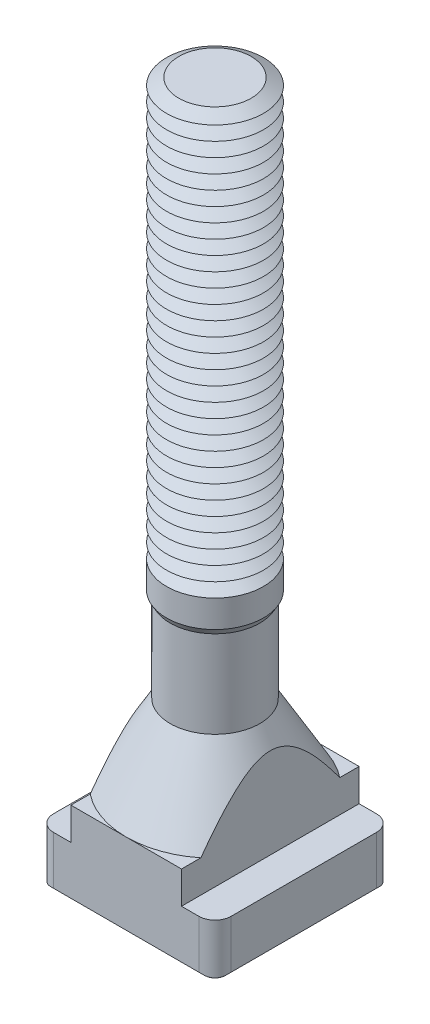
ISO-10303-21;
HEADER;
FILE_DESCRIPTION(('STEP AP214'),'2;1');
FILE_NAME('part.step','',(''),(''),'','','');
FILE_SCHEMA(('AUTOMOTIVE_DESIGN { 1 0 10303 214 1 1 1 1 }'));
ENDSEC;
DATA;
#1=APPLICATION_CONTEXT('core data for automotive mechanical design processes');
#2=APPLICATION_PROTOCOL_DEFINITION('international standard','automotive_design',2000,#1);
#3=PRODUCT_CONTEXT('',#1,'mechanical');
#4=PRODUCT('Part','Part','',(#3));
#5=PRODUCT_RELATED_PRODUCT_CATEGORY('part','',(#4));
#6=PRODUCT_DEFINITION_FORMATION('','',#4);
#7=PRODUCT_DEFINITION_CONTEXT('part definition',#1,'design');
#8=PRODUCT_DEFINITION('design','',#6,#7);
#9=PRODUCT_DEFINITION_SHAPE('','',#8);
#10=(LENGTH_UNIT() NAMED_UNIT(*) SI_UNIT(.MILLI.,.METRE.));
#11=(NAMED_UNIT(*) PLANE_ANGLE_UNIT() SI_UNIT($,.RADIAN.));
#12=(NAMED_UNIT(*) SI_UNIT($,.STERADIAN.) SOLID_ANGLE_UNIT());
#13=UNCERTAINTY_MEASURE_WITH_UNIT(LENGTH_MEASURE(1.E-05),#10,'distance_accuracy_value','');
#14=(GEOMETRIC_REPRESENTATION_CONTEXT(3) GLOBAL_UNCERTAINTY_ASSIGNED_CONTEXT((#13)) GLOBAL_UNIT_ASSIGNED_CONTEXT((#10,
#11,#12)) REPRESENTATION_CONTEXT('',''));
#15=CARTESIAN_POINT('',(0.,0.,0.));
#16=DIRECTION('',(0.,0.,1.));
#17=DIRECTION('',(1.,0.,0.));
#18=AXIS2_PLACEMENT_3D('',#15,#16,#17);
#19=CARTESIAN_POINT('',(0.,81.,0.));
#20=DIRECTION('',(0.,-1.,0.));
#21=DIRECTION('',(0.,0.,-1.));
#22=AXIS2_PLACEMENT_3D('',#19,#20,#21);
#23=CONICAL_SURFACE('',#22,4.48445554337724,1.0471975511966);
#24=CARTESIAN_POINT('',(0.,80.125,0.));
#25=DIRECTION('',(0.,-1.,0.));
#26=DIRECTION('',(0.,0.,-1.));
#27=AXIS2_PLACEMENT_3D('',#24,#25,#26);
#28=CIRCLE('',#27,6.00000000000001);
#29=CARTESIAN_POINT('',(0.,80.125,-6.00000000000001));
#30=VERTEX_POINT('',#29);
#31=EDGE_CURVE('E770',#30,#30,#28,.T.);
#32=ORIENTED_EDGE('',*,*,#31,.F.);
#33=EDGE_LOOP('',(#32));
#34=FACE_BOUND('',#33,.T.);
#35=CARTESIAN_POINT('',(0.,81.,0.));
#36=DIRECTION('',(0.,-1.,0.));
#37=DIRECTION('',(0.,0.,-1.));
#38=AXIS2_PLACEMENT_3D('',#35,#36,#37);
#39=CIRCLE('',#38,4.48445554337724);
#40=CARTESIAN_POINT('',(0.,81.,-4.48445554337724));
#41=VERTEX_POINT('',#40);
#42=EDGE_CURVE('E764',#41,#41,#39,.T.);
#43=ORIENTED_EDGE('',*,*,#42,.T.);
#44=EDGE_LOOP('',(#43));
#45=FACE_BOUND('',#44,.T.);
#46=ADVANCED_FACE('F39',(#34,#45),#23,.T.);
#47=CARTESIAN_POINT('',(0.,81.875,0.));
#48=DIRECTION('',(0.,1.,0.));
#49=DIRECTION('',(0.,0.,1.));
#50=AXIS2_PLACEMENT_3D('',#47,#48,#49);
#51=CONICAL_SURFACE('',#50,6.00000000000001,1.0471975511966);
#52=ORIENTED_EDGE('',*,*,#42,.F.);
#53=EDGE_LOOP('',(#52));
#54=FACE_BOUND('',#53,.T.);
#55=CARTESIAN_POINT('',(0.,81.875,0.));
#56=DIRECTION('',(0.,-1.,0.));
#57=DIRECTION('',(0.,0.,-1.));
#58=AXIS2_PLACEMENT_3D('',#55,#56,#57);
#59=CIRCLE('',#58,6.00000000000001);
#60=CARTESIAN_POINT('',(0.,81.875,-6.00000000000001));
#61=VERTEX_POINT('',#60);
#62=EDGE_CURVE('E647',#61,#61,#59,.T.);
#63=ORIENTED_EDGE('',*,*,#62,.T.);
#64=EDGE_LOOP('',(#63));
#65=FACE_BOUND('',#64,.T.);
#66=ADVANCED_FACE('F449',(#54,#65),#51,.T.);
#67=CARTESIAN_POINT('',(2.99918038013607,88.,0.));
#68=DIRECTION('',(0.,-1.,0.));
#69=DIRECTION('',(1.,0.,0.));
#70=AXIS2_PLACEMENT_3D('',#67,#68,#69);
#71=PLANE('',#70);
#72=CARTESIAN_POINT('',(0.,88.,0.));
#73=DIRECTION('',(0.,-1.,0.));
#74=DIRECTION('',(0.,0.,-1.));
#75=AXIS2_PLACEMENT_3D('',#72,#73,#74);
#76=CIRCLE('',#75,4.48445554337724);
#77=CARTESIAN_POINT('',(0.,88.,-4.48445554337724));
#78=VERTEX_POINT('',#77);
#79=EDGE_CURVE('E649',#78,#78,#76,.T.);
#80=ORIENTED_EDGE('',*,*,#79,.F.);
#81=EDGE_LOOP('',(#80));
#82=FACE_BOUND('',#81,.T.);
#83=ADVANCED_FACE('F455',(#82),#71,.F.);
#84=CARTESIAN_POINT('',(0.,88.,0.));
#85=DIRECTION('',(0.,-1.,0.));
#86=DIRECTION('',(0.,0.,-1.));
#87=AXIS2_PLACEMENT_3D('',#84,#85,#86);
#88=CONICAL_SURFACE('',#87,4.48445554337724,1.0471975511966);
#89=CARTESIAN_POINT('',(0.,87.125,0.));
#90=DIRECTION('',(0.,-1.,0.));
#91=DIRECTION('',(0.,0.,-1.));
#92=AXIS2_PLACEMENT_3D('',#89,#90,#91);
#93=CIRCLE('',#92,6.00000000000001);
#94=CARTESIAN_POINT('',(0.,87.125,-6.00000000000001));
#95=VERTEX_POINT('',#94);
#96=EDGE_CURVE('E652',#95,#95,#93,.T.);
#97=ORIENTED_EDGE('',*,*,#96,.F.);
#98=EDGE_LOOP('',(#97));
#99=FACE_BOUND('',#98,.T.);
#100=ORIENTED_EDGE('',*,*,#79,.T.);
#101=EDGE_LOOP('',(#100));
#102=FACE_BOUND('',#101,.T.);
#103=ADVANCED_FACE('F483',(#99,#102),#88,.T.);
#104=CARTESIAN_POINT('',(0.,87.125,0.));
#105=DIRECTION('',(0.,1.,0.));
#106=DIRECTION('',(0.,0.,1.));
#107=AXIS2_PLACEMENT_3D('',#104,#105,#106);
#108=CONICAL_SURFACE('',#107,6.00000000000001,1.0471975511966);
#109=CARTESIAN_POINT('',(0.,86.25,0.));
#110=DIRECTION('',(0.,-1.,0.));
#111=DIRECTION('',(0.,0.,-1.));
#112=AXIS2_PLACEMENT_3D('',#109,#110,#111);
#113=CIRCLE('',#112,4.48445554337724);
#114=CARTESIAN_POINT('',(0.,86.25,-4.48445554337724));
#115=VERTEX_POINT('',#114);
#116=EDGE_CURVE('E711',#115,#115,#113,.T.);
#117=ORIENTED_EDGE('',*,*,#116,.F.);
#118=EDGE_LOOP('',(#117));
#119=FACE_BOUND('',#118,.T.);
#120=ORIENTED_EDGE('',*,*,#96,.T.);
#121=EDGE_LOOP('',(#120));
#122=FACE_BOUND('',#121,.T.);
#123=ADVANCED_FACE('F480',(#119,#122),#108,.T.);
#124=CARTESIAN_POINT('',(0.,86.25,0.));
#125=DIRECTION('',(0.,-1.,0.));
#126=DIRECTION('',(0.,0.,-1.));
#127=AXIS2_PLACEMENT_3D('',#124,#125,#126);
#128=CONICAL_SURFACE('',#127,4.48445554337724,1.0471975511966);
#129=CARTESIAN_POINT('',(0.,85.375,0.));
#130=DIRECTION('',(0.,-1.,0.));
#131=DIRECTION('',(0.,0.,-1.));
#132=AXIS2_PLACEMENT_3D('',#129,#130,#131);
#133=CIRCLE('',#132,6.00000000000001);
#134=CARTESIAN_POINT('',(0.,85.375,-6.00000000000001));
#135=VERTEX_POINT('',#134);
#136=EDGE_CURVE('E777',#135,#135,#133,.T.);
#137=ORIENTED_EDGE('',*,*,#136,.F.);
#138=EDGE_LOOP('',(#137));
#139=FACE_BOUND('',#138,.T.);
#140=ORIENTED_EDGE('',*,*,#116,.T.);
#141=EDGE_LOOP('',(#140));
#142=FACE_BOUND('',#141,.T.);
#143=ADVANCED_FACE('F475',(#139,#142),#128,.T.);
#144=CARTESIAN_POINT('',(0.,85.375,0.));
#145=DIRECTION('',(0.,1.,0.));
#146=DIRECTION('',(0.,0.,1.));
#147=AXIS2_PLACEMENT_3D('',#144,#145,#146);
#148=CONICAL_SURFACE('',#147,6.00000000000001,1.0471975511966);
#149=CARTESIAN_POINT('',(0.,84.5,0.));
#150=DIRECTION('',(0.,-1.,0.));
#151=DIRECTION('',(0.,0.,-1.));
#152=AXIS2_PLACEMENT_3D('',#149,#150,#151);
#153=CIRCLE('',#152,4.48445554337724);
#154=CARTESIAN_POINT('',(0.,84.5,-4.48445554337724));
#155=VERTEX_POINT('',#154);
#156=EDGE_CURVE('E739',#155,#155,#153,.T.);
#157=ORIENTED_EDGE('',*,*,#156,.F.);
#158=EDGE_LOOP('',(#157));
#159=FACE_BOUND('',#158,.T.);
#160=ORIENTED_EDGE('',*,*,#136,.T.);
#161=EDGE_LOOP('',(#160));
#162=FACE_BOUND('',#161,.T.);
#163=ADVANCED_FACE('F472',(#159,#162),#148,.T.);
#164=CARTESIAN_POINT('',(0.,84.5,0.));
#165=DIRECTION('',(0.,-1.,0.));
#166=DIRECTION('',(0.,0.,-1.));
#167=AXIS2_PLACEMENT_3D('',#164,#165,#166);
#168=CONICAL_SURFACE('',#167,4.48445554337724,1.0471975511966);
#169=CARTESIAN_POINT('',(0.,83.625,0.));
#170=DIRECTION('',(0.,-1.,0.));
#171=DIRECTION('',(0.,0.,-1.));
#172=AXIS2_PLACEMENT_3D('',#169,#170,#171);
#173=CIRCLE('',#172,6.00000000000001);
#174=CARTESIAN_POINT('',(0.,83.625,-6.00000000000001));
#175=VERTEX_POINT('',#174);
#176=EDGE_CURVE('E646',#175,#175,#173,.T.);
#177=ORIENTED_EDGE('',*,*,#176,.F.);
#178=EDGE_LOOP('',(#177));
#179=FACE_BOUND('',#178,.T.);
#180=ORIENTED_EDGE('',*,*,#156,.T.);
#181=EDGE_LOOP('',(#180));
#182=FACE_BOUND('',#181,.T.);
#183=ADVANCED_FACE('F466',(#179,#182),#168,.T.);
#184=CARTESIAN_POINT('',(0.,83.625,0.));
#185=DIRECTION('',(0.,1.,0.));
#186=DIRECTION('',(0.,0.,1.));
#187=AXIS2_PLACEMENT_3D('',#184,#185,#186);
#188=CONICAL_SURFACE('',#187,6.00000000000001,1.0471975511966);
#189=CARTESIAN_POINT('',(0.,82.75,0.));
#190=DIRECTION('',(0.,-1.,0.));
#191=DIRECTION('',(0.,0.,-1.));
#192=AXIS2_PLACEMENT_3D('',#189,#190,#191);
#193=CIRCLE('',#192,4.48445554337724);
#194=CARTESIAN_POINT('',(0.,82.75,-4.48445554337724));
#195=VERTEX_POINT('',#194);
#196=EDGE_CURVE('E643',#195,#195,#193,.T.);
#197=ORIENTED_EDGE('',*,*,#196,.F.);
#198=EDGE_LOOP('',(#197));
#199=FACE_BOUND('',#198,.T.);
#200=ORIENTED_EDGE('',*,*,#176,.T.);
#201=EDGE_LOOP('',(#200));
#202=FACE_BOUND('',#201,.T.);
#203=ADVANCED_FACE('F462',(#199,#202),#188,.T.);
#204=CARTESIAN_POINT('',(0.,82.75,0.));
#205=DIRECTION('',(0.,-1.,0.));
#206=DIRECTION('',(0.,0.,-1.));
#207=AXIS2_PLACEMENT_3D('',#204,#205,#206);
#208=CONICAL_SURFACE('',#207,4.48445554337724,1.0471975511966);
#209=ORIENTED_EDGE('',*,*,#62,.F.);
#210=EDGE_LOOP('',(#209));
#211=FACE_BOUND('',#210,.T.);
#212=ORIENTED_EDGE('',*,*,#196,.T.);
#213=EDGE_LOOP('',(#212));
#214=FACE_BOUND('',#213,.T.);
#215=ADVANCED_FACE('F465',(#211,#214),#208,.T.);
#216=CARTESIAN_POINT('',(0.,79.25,0.));
#217=DIRECTION('',(0.,-1.,0.));
#218=DIRECTION('',(0.,0.,-1.));
#219=AXIS2_PLACEMENT_3D('',#216,#217,#218);
#220=CONICAL_SURFACE('',#219,4.48445554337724,1.0471975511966);
#221=CARTESIAN_POINT('',(0.,78.375,0.));
#222=DIRECTION('',(0.,-1.,0.));
#223=DIRECTION('',(0.,0.,-1.));
#224=AXIS2_PLACEMENT_3D('',#221,#222,#223);
#225=CIRCLE('',#224,6.00000000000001);
#226=CARTESIAN_POINT('',(0.,78.375,-6.00000000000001));
#227=VERTEX_POINT('',#226);
#228=EDGE_CURVE('E704',#227,#227,#225,.T.);
#229=ORIENTED_EDGE('',*,*,#228,.F.);
#230=EDGE_LOOP('',(#229));
#231=FACE_BOUND('',#230,.T.);
#232=CARTESIAN_POINT('',(0.,79.25,0.));
#233=DIRECTION('',(0.,-1.,0.));
#234=DIRECTION('',(0.,0.,-1.));
#235=AXIS2_PLACEMENT_3D('',#232,#233,#234);
#236=CIRCLE('',#235,4.48445554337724);
#237=CARTESIAN_POINT('',(0.,79.25,-4.48445554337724));
#238=VERTEX_POINT('',#237);
#239=EDGE_CURVE('E707',#238,#238,#236,.T.);
#240=ORIENTED_EDGE('',*,*,#239,.T.);
#241=EDGE_LOOP('',(#240));
#242=FACE_BOUND('',#241,.T.);
#243=ADVANCED_FACE('F470',(#231,#242),#220,.T.);
#244=CARTESIAN_POINT('',(0.,80.125,0.));
#245=DIRECTION('',(0.,1.,0.));
#246=DIRECTION('',(0.,0.,1.));
#247=AXIS2_PLACEMENT_3D('',#244,#245,#246);
#248=CONICAL_SURFACE('',#247,6.00000000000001,1.0471975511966);
#249=ORIENTED_EDGE('',*,*,#239,.F.);
#250=EDGE_LOOP('',(#249));
#251=FACE_BOUND('',#250,.T.);
#252=ORIENTED_EDGE('',*,*,#31,.T.);
#253=EDGE_LOOP('',(#252));
#254=FACE_BOUND('',#253,.T.);
#255=ADVANCED_FACE('F845',(#251,#254),#248,.T.);
#256=CARTESIAN_POINT('',(0.,77.5,0.));
#257=DIRECTION('',(0.,-1.,0.));
#258=DIRECTION('',(0.,0.,-1.));
#259=AXIS2_PLACEMENT_3D('',#256,#257,#258);
#260=CONICAL_SURFACE('',#259,4.48445554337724,1.0471975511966);
#261=CARTESIAN_POINT('',(0.,76.625,0.));
#262=DIRECTION('',(0.,-1.,0.));
#263=DIRECTION('',(0.,0.,-1.));
#264=AXIS2_PLACEMENT_3D('',#261,#262,#263);
#265=CIRCLE('',#264,6.00000000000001);
#266=CARTESIAN_POINT('',(0.,76.625,-6.00000000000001));
#267=VERTEX_POINT('',#266);
#268=EDGE_CURVE('E803',#267,#267,#265,.T.);
#269=ORIENTED_EDGE('',*,*,#268,.F.);
#270=EDGE_LOOP('',(#269));
#271=FACE_BOUND('',#270,.T.);
#272=CARTESIAN_POINT('',(0.,77.5,0.));
#273=DIRECTION('',(0.,-1.,0.));
#274=DIRECTION('',(0.,0.,-1.));
#275=AXIS2_PLACEMENT_3D('',#272,#273,#274);
#276=CIRCLE('',#275,4.48445554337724);
#277=CARTESIAN_POINT('',(0.,77.5,-4.48445554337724));
#278=VERTEX_POINT('',#277);
#279=EDGE_CURVE('E708',#278,#278,#276,.T.);
#280=ORIENTED_EDGE('',*,*,#279,.T.);
#281=EDGE_LOOP('',(#280));
#282=FACE_BOUND('',#281,.T.);
#283=ADVANCED_FACE('F847',(#271,#282),#260,.T.);
#284=CARTESIAN_POINT('',(0.,78.375,0.));
#285=DIRECTION('',(0.,1.,0.));
#286=DIRECTION('',(0.,0.,1.));
#287=AXIS2_PLACEMENT_3D('',#284,#285,#286);
#288=CONICAL_SURFACE('',#287,6.00000000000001,1.0471975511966);
#289=ORIENTED_EDGE('',*,*,#279,.F.);
#290=EDGE_LOOP('',(#289));
#291=FACE_BOUND('',#290,.T.);
#292=ORIENTED_EDGE('',*,*,#228,.T.);
#293=EDGE_LOOP('',(#292));
#294=FACE_BOUND('',#293,.T.);
#295=ADVANCED_FACE('F854',(#291,#294),#288,.T.);
#296=CARTESIAN_POINT('',(0.,75.75,0.));
#297=DIRECTION('',(0.,-1.,0.));
#298=DIRECTION('',(0.,0.,-1.));
#299=AXIS2_PLACEMENT_3D('',#296,#297,#298);
#300=CONICAL_SURFACE('',#299,4.48445554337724,1.0471975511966);
#301=CARTESIAN_POINT('',(0.,74.875,0.));
#302=DIRECTION('',(0.,-1.,0.));
#303=DIRECTION('',(0.,0.,-1.));
#304=AXIS2_PLACEMENT_3D('',#301,#302,#303);
#305=CIRCLE('',#304,6.00000000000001);
#306=CARTESIAN_POINT('',(0.,74.875,-6.00000000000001));
#307=VERTEX_POINT('',#306);
#308=EDGE_CURVE('E761',#307,#307,#305,.T.);
#309=ORIENTED_EDGE('',*,*,#308,.F.);
#310=EDGE_LOOP('',(#309));
#311=FACE_BOUND('',#310,.T.);
#312=CARTESIAN_POINT('',(0.,75.75,0.));
#313=DIRECTION('',(0.,-1.,0.));
#314=DIRECTION('',(0.,0.,-1.));
#315=AXIS2_PLACEMENT_3D('',#312,#313,#314);
#316=CIRCLE('',#315,4.48445554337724);
#317=CARTESIAN_POINT('',(0.,75.75,-4.48445554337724));
#318=VERTEX_POINT('',#317);
#319=EDGE_CURVE('E805',#318,#318,#316,.T.);
#320=ORIENTED_EDGE('',*,*,#319,.T.);
#321=EDGE_LOOP('',(#320));
#322=FACE_BOUND('',#321,.T.);
#323=ADVANCED_FACE('F862',(#311,#322),#300,.T.);
#324=CARTESIAN_POINT('',(0.,76.625,0.));
#325=DIRECTION('',(0.,1.,0.));
#326=DIRECTION('',(0.,0.,1.));
#327=AXIS2_PLACEMENT_3D('',#324,#325,#326);
#328=CONICAL_SURFACE('',#327,6.00000000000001,1.0471975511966);
#329=ORIENTED_EDGE('',*,*,#319,.F.);
#330=EDGE_LOOP('',(#329));
#331=FACE_BOUND('',#330,.T.);
#332=ORIENTED_EDGE('',*,*,#268,.T.);
#333=EDGE_LOOP('',(#332));
#334=FACE_BOUND('',#333,.T.);
#335=ADVANCED_FACE('F866',(#331,#334),#328,.T.);
#336=CARTESIAN_POINT('',(0.,74.,0.));
#337=DIRECTION('',(0.,-1.,0.));
#338=DIRECTION('',(0.,0.,-1.));
#339=AXIS2_PLACEMENT_3D('',#336,#337,#338);
#340=CONICAL_SURFACE('',#339,4.48445554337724,1.0471975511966);
#341=CARTESIAN_POINT('',(0.,73.125,0.));
#342=DIRECTION('',(0.,-1.,0.));
#343=DIRECTION('',(0.,0.,-1.));
#344=AXIS2_PLACEMENT_3D('',#341,#342,#343);
#345=CIRCLE('',#344,6.00000000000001);
#346=CARTESIAN_POINT('',(0.,73.125,-6.00000000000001));
#347=VERTEX_POINT('',#346);
#348=EDGE_CURVE('E674',#347,#347,#345,.T.);
#349=ORIENTED_EDGE('',*,*,#348,.F.);
#350=EDGE_LOOP('',(#349));
#351=FACE_BOUND('',#350,.T.);
#352=CARTESIAN_POINT('',(0.,74.,0.));
#353=DIRECTION('',(0.,-1.,0.));
#354=DIRECTION('',(0.,0.,-1.));
#355=AXIS2_PLACEMENT_3D('',#352,#353,#354);
#356=CIRCLE('',#355,4.48445554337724);
#357=CARTESIAN_POINT('',(0.,74.,-4.48445554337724));
#358=VERTEX_POINT('',#357);
#359=EDGE_CURVE('E676',#358,#358,#356,.T.);
#360=ORIENTED_EDGE('',*,*,#359,.T.);
#361=EDGE_LOOP('',(#360));
#362=FACE_BOUND('',#361,.T.);
#363=ADVANCED_FACE('F870',(#351,#362),#340,.T.);
#364=CARTESIAN_POINT('',(0.,74.875,0.));
#365=DIRECTION('',(0.,1.,0.));
#366=DIRECTION('',(0.,0.,1.));
#367=AXIS2_PLACEMENT_3D('',#364,#365,#366);
#368=CONICAL_SURFACE('',#367,6.00000000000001,1.0471975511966);
#369=ORIENTED_EDGE('',*,*,#359,.F.);
#370=EDGE_LOOP('',(#369));
#371=FACE_BOUND('',#370,.T.);
#372=ORIENTED_EDGE('',*,*,#308,.T.);
#373=EDGE_LOOP('',(#372));
#374=FACE_BOUND('',#373,.T.);
#375=ADVANCED_FACE('F874',(#371,#374),#368,.T.);
#376=CARTESIAN_POINT('',(0.,72.25,0.));
#377=DIRECTION('',(0.,-1.,0.));
#378=DIRECTION('',(0.,0.,-1.));
#379=AXIS2_PLACEMENT_3D('',#376,#377,#378);
#380=CONICAL_SURFACE('',#379,4.48445554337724,1.0471975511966);
#381=CARTESIAN_POINT('',(0.,71.375,0.));
#382=DIRECTION('',(0.,-1.,0.));
#383=DIRECTION('',(0.,0.,-1.));
#384=AXIS2_PLACEMENT_3D('',#381,#382,#383);
#385=CIRCLE('',#384,6.00000000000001);
#386=CARTESIAN_POINT('',(0.,71.375,-6.00000000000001));
#387=VERTEX_POINT('',#386);
#388=EDGE_CURVE('E823',#387,#387,#385,.T.);
#389=ORIENTED_EDGE('',*,*,#388,.F.);
#390=EDGE_LOOP('',(#389));
#391=FACE_BOUND('',#390,.T.);
#392=CARTESIAN_POINT('',(0.,72.25,0.));
#393=DIRECTION('',(0.,-1.,0.));
#394=DIRECTION('',(0.,0.,-1.));
#395=AXIS2_PLACEMENT_3D('',#392,#393,#394);
#396=CIRCLE('',#395,4.48445554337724);
#397=CARTESIAN_POINT('',(0.,72.25,-4.48445554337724));
#398=VERTEX_POINT('',#397);
#399=EDGE_CURVE('E677',#398,#398,#396,.T.);
#400=ORIENTED_EDGE('',*,*,#399,.T.);
#401=EDGE_LOOP('',(#400));
#402=FACE_BOUND('',#401,.T.);
#403=ADVANCED_FACE('F878',(#391,#402),#380,.T.);
#404=CARTESIAN_POINT('',(0.,73.125,0.));
#405=DIRECTION('',(0.,1.,0.));
#406=DIRECTION('',(0.,0.,1.));
#407=AXIS2_PLACEMENT_3D('',#404,#405,#406);
#408=CONICAL_SURFACE('',#407,6.00000000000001,1.0471975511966);
#409=ORIENTED_EDGE('',*,*,#399,.F.);
#410=EDGE_LOOP('',(#409));
#411=FACE_BOUND('',#410,.T.);
#412=ORIENTED_EDGE('',*,*,#348,.T.);
#413=EDGE_LOOP('',(#412));
#414=FACE_BOUND('',#413,.T.);
#415=ADVANCED_FACE('F882',(#411,#414),#408,.T.);
#416=CARTESIAN_POINT('',(0.,70.5,0.));
#417=DIRECTION('',(0.,-1.,0.));
#418=DIRECTION('',(0.,0.,-1.));
#419=AXIS2_PLACEMENT_3D('',#416,#417,#418);
#420=CONICAL_SURFACE('',#419,4.48445554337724,1.0471975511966);
#421=CARTESIAN_POINT('',(0.,69.625,0.));
#422=DIRECTION('',(0.,-1.,0.));
#423=DIRECTION('',(0.,0.,-1.));
#424=AXIS2_PLACEMENT_3D('',#421,#422,#423);
#425=CIRCLE('',#424,6.00000000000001);
#426=CARTESIAN_POINT('',(0.,69.625,-6.00000000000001));
#427=VERTEX_POINT('',#426);
#428=EDGE_CURVE('E732',#427,#427,#425,.T.);
#429=ORIENTED_EDGE('',*,*,#428,.F.);
#430=EDGE_LOOP('',(#429));
#431=FACE_BOUND('',#430,.T.);
#432=CARTESIAN_POINT('',(0.,70.5,0.));
#433=DIRECTION('',(0.,-1.,0.));
#434=DIRECTION('',(0.,0.,-1.));
#435=AXIS2_PLACEMENT_3D('',#432,#433,#434);
#436=CIRCLE('',#435,4.48445554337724);
#437=CARTESIAN_POINT('',(0.,70.5,-4.48445554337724));
#438=VERTEX_POINT('',#437);
#439=EDGE_CURVE('E735',#438,#438,#436,.T.);
#440=ORIENTED_EDGE('',*,*,#439,.T.);
#441=EDGE_LOOP('',(#440));
#442=FACE_BOUND('',#441,.T.);
#443=ADVANCED_FACE('F886',(#431,#442),#420,.T.);
#444=CARTESIAN_POINT('',(0.,71.375,0.));
#445=DIRECTION('',(0.,1.,0.));
#446=DIRECTION('',(0.,0.,1.));
#447=AXIS2_PLACEMENT_3D('',#444,#445,#446);
#448=CONICAL_SURFACE('',#447,6.00000000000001,1.0471975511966);
#449=ORIENTED_EDGE('',*,*,#439,.F.);
#450=EDGE_LOOP('',(#449));
#451=FACE_BOUND('',#450,.T.);
#452=ORIENTED_EDGE('',*,*,#388,.T.);
#453=EDGE_LOOP('',(#452));
#454=FACE_BOUND('',#453,.T.);
#455=ADVANCED_FACE('F890',(#451,#454),#448,.T.);
#456=CARTESIAN_POINT('',(0.,68.75,0.));
#457=DIRECTION('',(0.,-1.,0.));
#458=DIRECTION('',(0.,0.,-1.));
#459=AXIS2_PLACEMENT_3D('',#456,#457,#458);
#460=CONICAL_SURFACE('',#459,4.48445554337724,1.0471975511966);
#461=CARTESIAN_POINT('',(0.,67.875,0.));
#462=DIRECTION('',(0.,-1.,0.));
#463=DIRECTION('',(0.,0.,-1.));
#464=AXIS2_PLACEMENT_3D('',#461,#462,#463);
#465=CIRCLE('',#464,6.00000000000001);
#466=CARTESIAN_POINT('',(0.,67.875,-6.00000000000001));
#467=VERTEX_POINT('',#466);
#468=EDGE_CURVE('E702',#467,#467,#465,.T.);
#469=ORIENTED_EDGE('',*,*,#468,.F.);
#470=EDGE_LOOP('',(#469));
#471=FACE_BOUND('',#470,.T.);
#472=CARTESIAN_POINT('',(0.,68.75,0.));
#473=DIRECTION('',(0.,-1.,0.));
#474=DIRECTION('',(0.,0.,-1.));
#475=AXIS2_PLACEMENT_3D('',#472,#473,#474);
#476=CIRCLE('',#475,4.48445554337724);
#477=CARTESIAN_POINT('',(0.,68.75,-4.48445554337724));
#478=VERTEX_POINT('',#477);
#479=EDGE_CURVE('E736',#478,#478,#476,.T.);
#480=ORIENTED_EDGE('',*,*,#479,.T.);
#481=EDGE_LOOP('',(#480));
#482=FACE_BOUND('',#481,.T.);
#483=ADVANCED_FACE('F894',(#471,#482),#460,.T.);
#484=CARTESIAN_POINT('',(0.,69.625,0.));
#485=DIRECTION('',(0.,1.,0.));
#486=DIRECTION('',(0.,0.,1.));
#487=AXIS2_PLACEMENT_3D('',#484,#485,#486);
#488=CONICAL_SURFACE('',#487,6.00000000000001,1.0471975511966);
#489=ORIENTED_EDGE('',*,*,#479,.F.);
#490=EDGE_LOOP('',(#489));
#491=FACE_BOUND('',#490,.T.);
#492=ORIENTED_EDGE('',*,*,#428,.T.);
#493=EDGE_LOOP('',(#492));
#494=FACE_BOUND('',#493,.T.);
#495=ADVANCED_FACE('F898',(#491,#494),#488,.T.);
#496=CARTESIAN_POINT('',(0.,67.,0.));
#497=DIRECTION('',(0.,-1.,0.));
#498=DIRECTION('',(0.,0.,-1.));
#499=AXIS2_PLACEMENT_3D('',#496,#497,#498);
#500=CONICAL_SURFACE('',#499,4.48445554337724,1.0471975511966);
#501=CARTESIAN_POINT('',(0.,66.125,0.));
#502=DIRECTION('',(0.,-1.,0.));
#503=DIRECTION('',(0.,0.,-1.));
#504=AXIS2_PLACEMENT_3D('',#501,#502,#503);
#505=CIRCLE('',#504,6.00000000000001);
#506=CARTESIAN_POINT('',(0.,66.125,-6.00000000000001));
#507=VERTEX_POINT('',#506);
#508=EDGE_CURVE('E636',#507,#507,#505,.T.);
#509=ORIENTED_EDGE('',*,*,#508,.F.);
#510=EDGE_LOOP('',(#509));
#511=FACE_BOUND('',#510,.T.);
#512=CARTESIAN_POINT('',(0.,67.,0.));
#513=DIRECTION('',(0.,-1.,0.));
#514=DIRECTION('',(0.,0.,-1.));
#515=AXIS2_PLACEMENT_3D('',#512,#513,#514);
#516=CIRCLE('',#515,4.48445554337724);
#517=CARTESIAN_POINT('',(0.,67.,-4.48445554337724));
#518=VERTEX_POINT('',#517);
#519=EDGE_CURVE('E641',#518,#518,#516,.T.);
#520=ORIENTED_EDGE('',*,*,#519,.T.);
#521=EDGE_LOOP('',(#520));
#522=FACE_BOUND('',#521,.T.);
#523=ADVANCED_FACE('F902',(#511,#522),#500,.T.);
#524=CARTESIAN_POINT('',(0.,67.875,0.));
#525=DIRECTION('',(0.,1.,0.));
#526=DIRECTION('',(0.,0.,1.));
#527=AXIS2_PLACEMENT_3D('',#524,#525,#526);
#528=CONICAL_SURFACE('',#527,6.00000000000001,1.0471975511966);
#529=ORIENTED_EDGE('',*,*,#519,.F.);
#530=EDGE_LOOP('',(#529));
#531=FACE_BOUND('',#530,.T.);
#532=ORIENTED_EDGE('',*,*,#468,.T.);
#533=EDGE_LOOP('',(#532));
#534=FACE_BOUND('',#533,.T.);
#535=ADVANCED_FACE('F906',(#531,#534),#528,.T.);
#536=CARTESIAN_POINT('',(0.,65.25,0.));
#537=DIRECTION('',(0.,-1.,0.));
#538=DIRECTION('',(0.,0.,-1.));
#539=AXIS2_PLACEMENT_3D('',#536,#537,#538);
#540=CONICAL_SURFACE('',#539,4.48445554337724,1.0471975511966);
#541=CARTESIAN_POINT('',(0.,64.375,0.));
#542=DIRECTION('',(0.,-1.,0.));
#543=DIRECTION('',(0.,0.,-1.));
#544=AXIS2_PLACEMENT_3D('',#541,#542,#543);
#545=CIRCLE('',#544,6.00000000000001);
#546=CARTESIAN_POINT('',(0.,64.375,-6.00000000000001));
#547=VERTEX_POINT('',#546);
#548=EDGE_CURVE('E637',#547,#547,#545,.T.);
#549=ORIENTED_EDGE('',*,*,#548,.F.);
#550=EDGE_LOOP('',(#549));
#551=FACE_BOUND('',#550,.T.);
#552=CARTESIAN_POINT('',(0.,65.25,0.));
#553=DIRECTION('',(0.,-1.,0.));
#554=DIRECTION('',(0.,0.,-1.));
#555=AXIS2_PLACEMENT_3D('',#552,#553,#554);
#556=CIRCLE('',#555,4.48445554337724);
#557=CARTESIAN_POINT('',(0.,65.25,-4.48445554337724));
#558=VERTEX_POINT('',#557);
#559=EDGE_CURVE('E633',#558,#558,#556,.T.);
#560=ORIENTED_EDGE('',*,*,#559,.T.);
#561=EDGE_LOOP('',(#560));
#562=FACE_BOUND('',#561,.T.);
#563=ADVANCED_FACE('F910',(#551,#562),#540,.T.);
#564=CARTESIAN_POINT('',(0.,66.125,0.));
#565=DIRECTION('',(0.,1.,0.));
#566=DIRECTION('',(0.,0.,1.));
#567=AXIS2_PLACEMENT_3D('',#564,#565,#566);
#568=CONICAL_SURFACE('',#567,6.00000000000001,1.0471975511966);
#569=ORIENTED_EDGE('',*,*,#559,.F.);
#570=EDGE_LOOP('',(#569));
#571=FACE_BOUND('',#570,.T.);
#572=ORIENTED_EDGE('',*,*,#508,.T.);
#573=EDGE_LOOP('',(#572));
#574=FACE_BOUND('',#573,.T.);
#575=ADVANCED_FACE('F914',(#571,#574),#568,.T.);
#576=CARTESIAN_POINT('',(0.,63.5,0.));
#577=DIRECTION('',(0.,-1.,0.));
#578=DIRECTION('',(0.,0.,-1.));
#579=AXIS2_PLACEMENT_3D('',#576,#577,#578);
#580=CONICAL_SURFACE('',#579,4.48445554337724,1.0471975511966);
#581=CARTESIAN_POINT('',(0.,62.625,0.));
#582=DIRECTION('',(0.,-1.,0.));
#583=DIRECTION('',(0.,0.,-1.));
#584=AXIS2_PLACEMENT_3D('',#581,#582,#583);
#585=CIRCLE('',#584,6.00000000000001);
#586=CARTESIAN_POINT('',(0.,62.625,-6.00000000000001));
#587=VERTEX_POINT('',#586);
#588=EDGE_CURVE('E694',#587,#587,#585,.T.);
#589=ORIENTED_EDGE('',*,*,#588,.F.);
#590=EDGE_LOOP('',(#589));
#591=FACE_BOUND('',#590,.T.);
#592=CARTESIAN_POINT('',(0.,63.5,0.));
#593=DIRECTION('',(0.,-1.,0.));
#594=DIRECTION('',(0.,0.,-1.));
#595=AXIS2_PLACEMENT_3D('',#592,#593,#594);
#596=CIRCLE('',#595,4.48445554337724);
#597=CARTESIAN_POINT('',(0.,63.5,-4.48445554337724));
#598=VERTEX_POINT('',#597);
#599=EDGE_CURVE('E697',#598,#598,#596,.T.);
#600=ORIENTED_EDGE('',*,*,#599,.T.);
#601=EDGE_LOOP('',(#600));
#602=FACE_BOUND('',#601,.T.);
#603=ADVANCED_FACE('F918',(#591,#602),#580,.T.);
#604=CARTESIAN_POINT('',(0.,64.375,0.));
#605=DIRECTION('',(0.,1.,0.));
#606=DIRECTION('',(0.,0.,1.));
#607=AXIS2_PLACEMENT_3D('',#604,#605,#606);
#608=CONICAL_SURFACE('',#607,6.00000000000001,1.0471975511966);
#609=ORIENTED_EDGE('',*,*,#599,.F.);
#610=EDGE_LOOP('',(#609));
#611=FACE_BOUND('',#610,.T.);
#612=ORIENTED_EDGE('',*,*,#548,.T.);
#613=EDGE_LOOP('',(#612));
#614=FACE_BOUND('',#613,.T.);
#615=ADVANCED_FACE('F922',(#611,#614),#608,.T.);
#616=CARTESIAN_POINT('',(0.,61.75,0.));
#617=DIRECTION('',(0.,-1.,0.));
#618=DIRECTION('',(0.,0.,-1.));
#619=AXIS2_PLACEMENT_3D('',#616,#617,#618);
#620=CONICAL_SURFACE('',#619,4.48445554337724,1.0471975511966);
#621=CARTESIAN_POINT('',(0.,60.875,0.));
#622=DIRECTION('',(0.,-1.,0.));
#623=DIRECTION('',(0.,0.,-1.));
#624=AXIS2_PLACEMENT_3D('',#621,#622,#623);
#625=CIRCLE('',#624,6.00000000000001);
#626=CARTESIAN_POINT('',(0.,60.875,-6.00000000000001));
#627=VERTEX_POINT('',#626);
#628=EDGE_CURVE('E754',#627,#627,#625,.T.);
#629=ORIENTED_EDGE('',*,*,#628,.F.);
#630=EDGE_LOOP('',(#629));
#631=FACE_BOUND('',#630,.T.);
#632=CARTESIAN_POINT('',(0.,61.75,0.));
#633=DIRECTION('',(0.,-1.,0.));
#634=DIRECTION('',(0.,0.,-1.));
#635=AXIS2_PLACEMENT_3D('',#632,#633,#634);
#636=CIRCLE('',#635,4.48445554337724);
#637=CARTESIAN_POINT('',(0.,61.75,-4.48445554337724));
#638=VERTEX_POINT('',#637);
#639=EDGE_CURVE('E698',#638,#638,#636,.T.);
#640=ORIENTED_EDGE('',*,*,#639,.T.);
#641=EDGE_LOOP('',(#640));
#642=FACE_BOUND('',#641,.T.);
#643=ADVANCED_FACE('F926',(#631,#642),#620,.T.);
#644=CARTESIAN_POINT('',(0.,62.625,0.));
#645=DIRECTION('',(0.,1.,0.));
#646=DIRECTION('',(0.,0.,1.));
#647=AXIS2_PLACEMENT_3D('',#644,#645,#646);
#648=CONICAL_SURFACE('',#647,6.00000000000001,1.0471975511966);
#649=ORIENTED_EDGE('',*,*,#639,.F.);
#650=EDGE_LOOP('',(#649));
#651=FACE_BOUND('',#650,.T.);
#652=ORIENTED_EDGE('',*,*,#588,.T.);
#653=EDGE_LOOP('',(#652));
#654=FACE_BOUND('',#653,.T.);
#655=ADVANCED_FACE('F930',(#651,#654),#648,.T.);
#656=CARTESIAN_POINT('',(0.,60.,0.));
#657=DIRECTION('',(0.,-1.,0.));
#658=DIRECTION('',(0.,0.,-1.));
#659=AXIS2_PLACEMENT_3D('',#656,#657,#658);
#660=CONICAL_SURFACE('',#659,4.48445554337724,1.0471975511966);
#661=CARTESIAN_POINT('',(0.,59.125,0.));
#662=DIRECTION('',(0.,-1.,0.));
#663=DIRECTION('',(0.,0.,-1.));
#664=AXIS2_PLACEMENT_3D('',#661,#662,#663);
#665=CIRCLE('',#664,6.00000000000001);
#666=CARTESIAN_POINT('',(0.,59.125,-6.00000000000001));
#667=VERTEX_POINT('',#666);
#668=EDGE_CURVE('E801',#667,#667,#665,.T.);
#669=ORIENTED_EDGE('',*,*,#668,.F.);
#670=EDGE_LOOP('',(#669));
#671=FACE_BOUND('',#670,.T.);
#672=CARTESIAN_POINT('',(0.,60.,0.));
#673=DIRECTION('',(0.,-1.,0.));
#674=DIRECTION('',(0.,0.,-1.));
#675=AXIS2_PLACEMENT_3D('',#672,#673,#674);
#676=CIRCLE('',#675,4.48445554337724);
#677=CARTESIAN_POINT('',(0.,60.,-4.48445554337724));
#678=VERTEX_POINT('',#677);
#679=EDGE_CURVE('E757',#678,#678,#676,.T.);
#680=ORIENTED_EDGE('',*,*,#679,.T.);
#681=EDGE_LOOP('',(#680));
#682=FACE_BOUND('',#681,.T.);
#683=ADVANCED_FACE('F934',(#671,#682),#660,.T.);
#684=CARTESIAN_POINT('',(0.,60.875,0.));
#685=DIRECTION('',(0.,1.,0.));
#686=DIRECTION('',(0.,0.,1.));
#687=AXIS2_PLACEMENT_3D('',#684,#685,#686);
#688=CONICAL_SURFACE('',#687,6.00000000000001,1.0471975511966);
#689=ORIENTED_EDGE('',*,*,#679,.F.);
#690=EDGE_LOOP('',(#689));
#691=FACE_BOUND('',#690,.T.);
#692=ORIENTED_EDGE('',*,*,#628,.T.);
#693=EDGE_LOOP('',(#692));
#694=FACE_BOUND('',#693,.T.);
#695=ADVANCED_FACE('F938',(#691,#694),#688,.T.);
#696=CARTESIAN_POINT('',(0.,58.25,0.));
#697=DIRECTION('',(0.,-1.,0.));
#698=DIRECTION('',(0.,0.,-1.));
#699=AXIS2_PLACEMENT_3D('',#696,#697,#698);
#700=CONICAL_SURFACE('',#699,4.48445554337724,1.0471975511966);
#701=CARTESIAN_POINT('',(0.,57.375,0.));
#702=DIRECTION('',(0.,-1.,0.));
#703=DIRECTION('',(0.,0.,-1.));
#704=AXIS2_PLACEMENT_3D('',#701,#702,#703);
#705=CIRCLE('',#704,6.00000000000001);
#706=CARTESIAN_POINT('',(0.,57.375,-6.00000000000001));
#707=VERTEX_POINT('',#706);
#708=EDGE_CURVE('E726',#707,#707,#705,.T.);
#709=ORIENTED_EDGE('',*,*,#708,.F.);
#710=EDGE_LOOP('',(#709));
#711=FACE_BOUND('',#710,.T.);
#712=CARTESIAN_POINT('',(0.,58.25,0.));
#713=DIRECTION('',(0.,-1.,0.));
#714=DIRECTION('',(0.,0.,-1.));
#715=AXIS2_PLACEMENT_3D('',#712,#713,#714);
#716=CIRCLE('',#715,4.48445554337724);
#717=CARTESIAN_POINT('',(0.,58.25,-4.48445554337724));
#718=VERTEX_POINT('',#717);
#719=EDGE_CURVE('E729',#718,#718,#716,.T.);
#720=ORIENTED_EDGE('',*,*,#719,.T.);
#721=EDGE_LOOP('',(#720));
#722=FACE_BOUND('',#721,.T.);
#723=ADVANCED_FACE('F942',(#711,#722),#700,.T.);
#724=CARTESIAN_POINT('',(0.,59.125,0.));
#725=DIRECTION('',(0.,1.,0.));
#726=DIRECTION('',(0.,0.,1.));
#727=AXIS2_PLACEMENT_3D('',#724,#725,#726);
#728=CONICAL_SURFACE('',#727,6.00000000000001,1.0471975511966);
#729=ORIENTED_EDGE('',*,*,#719,.F.);
#730=EDGE_LOOP('',(#729));
#731=FACE_BOUND('',#730,.T.);
#732=ORIENTED_EDGE('',*,*,#668,.T.);
#733=EDGE_LOOP('',(#732));
#734=FACE_BOUND('',#733,.T.);
#735=ADVANCED_FACE('F946',(#731,#734),#728,.T.);
#736=CARTESIAN_POINT('',(0.,56.5,0.));
#737=DIRECTION('',(0.,-1.,0.));
#738=DIRECTION('',(0.,0.,-1.));
#739=AXIS2_PLACEMENT_3D('',#736,#737,#738);
#740=CONICAL_SURFACE('',#739,4.48445554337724,1.0471975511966);
#741=CARTESIAN_POINT('',(0.,55.625,0.));
#742=DIRECTION('',(0.,-1.,0.));
#743=DIRECTION('',(0.,0.,-1.));
#744=AXIS2_PLACEMENT_3D('',#741,#742,#743);
#745=CIRCLE('',#744,6.00000000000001);
#746=CARTESIAN_POINT('',(0.,55.625,-6.00000000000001));
#747=VERTEX_POINT('',#746);
#748=EDGE_CURVE('E797',#747,#747,#745,.T.);
#749=ORIENTED_EDGE('',*,*,#748,.F.);
#750=EDGE_LOOP('',(#749));
#751=FACE_BOUND('',#750,.T.);
#752=CARTESIAN_POINT('',(0.,56.5,0.));
#753=DIRECTION('',(0.,-1.,0.));
#754=DIRECTION('',(0.,0.,-1.));
#755=AXIS2_PLACEMENT_3D('',#752,#753,#754);
#756=CIRCLE('',#755,4.48445554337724);
#757=CARTESIAN_POINT('',(0.,56.5,-4.48445554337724));
#758=VERTEX_POINT('',#757);
#759=EDGE_CURVE('E730',#758,#758,#756,.T.);
#760=ORIENTED_EDGE('',*,*,#759,.T.);
#761=EDGE_LOOP('',(#760));
#762=FACE_BOUND('',#761,.T.);
#763=ADVANCED_FACE('F950',(#751,#762),#740,.T.);
#764=CARTESIAN_POINT('',(0.,57.375,0.));
#765=DIRECTION('',(0.,1.,0.));
#766=DIRECTION('',(0.,0.,1.));
#767=AXIS2_PLACEMENT_3D('',#764,#765,#766);
#768=CONICAL_SURFACE('',#767,6.00000000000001,1.0471975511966);
#769=ORIENTED_EDGE('',*,*,#759,.F.);
#770=EDGE_LOOP('',(#769));
#771=FACE_BOUND('',#770,.T.);
#772=ORIENTED_EDGE('',*,*,#708,.T.);
#773=EDGE_LOOP('',(#772));
#774=FACE_BOUND('',#773,.T.);
#775=ADVANCED_FACE('F954',(#771,#774),#768,.T.);
#776=CARTESIAN_POINT('',(0.,54.75,0.));
#777=DIRECTION('',(0.,-1.,0.));
#778=DIRECTION('',(0.,0.,-1.));
#779=AXIS2_PLACEMENT_3D('',#776,#777,#778);
#780=CONICAL_SURFACE('',#779,4.48445554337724,1.0471975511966);
#781=CARTESIAN_POINT('',(0.,53.875,0.));
#782=DIRECTION('',(0.,-1.,0.));
#783=DIRECTION('',(0.,0.,-1.));
#784=AXIS2_PLACEMENT_3D('',#781,#782,#783);
#785=CIRCLE('',#784,6.00000000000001);
#786=CARTESIAN_POINT('',(0.,53.875,-6.00000000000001));
#787=VERTEX_POINT('',#786);
#788=EDGE_CURVE('E671',#787,#787,#785,.T.);
#789=ORIENTED_EDGE('',*,*,#788,.F.);
#790=EDGE_LOOP('',(#789));
#791=FACE_BOUND('',#790,.T.);
#792=CARTESIAN_POINT('',(0.,54.75,0.));
#793=DIRECTION('',(0.,-1.,0.));
#794=DIRECTION('',(0.,0.,-1.));
#795=AXIS2_PLACEMENT_3D('',#792,#793,#794);
#796=CIRCLE('',#795,4.48445554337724);
#797=CARTESIAN_POINT('',(0.,54.75,-4.48445554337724));
#798=VERTEX_POINT('',#797);
#799=EDGE_CURVE('E724',#798,#798,#796,.T.);
#800=ORIENTED_EDGE('',*,*,#799,.T.);
#801=EDGE_LOOP('',(#800));
#802=FACE_BOUND('',#801,.T.);
#803=ADVANCED_FACE('F958',(#791,#802),#780,.T.);
#804=CARTESIAN_POINT('',(0.,55.625,0.));
#805=DIRECTION('',(0.,1.,0.));
#806=DIRECTION('',(0.,0.,1.));
#807=AXIS2_PLACEMENT_3D('',#804,#805,#806);
#808=CONICAL_SURFACE('',#807,6.00000000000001,1.0471975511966);
#809=ORIENTED_EDGE('',*,*,#799,.F.);
#810=EDGE_LOOP('',(#809));
#811=FACE_BOUND('',#810,.T.);
#812=ORIENTED_EDGE('',*,*,#748,.T.);
#813=EDGE_LOOP('',(#812));
#814=FACE_BOUND('',#813,.T.);
#815=ADVANCED_FACE('F962',(#811,#814),#808,.T.);
#816=CARTESIAN_POINT('',(0.,53.,0.));
#817=DIRECTION('',(0.,-1.,0.));
#818=DIRECTION('',(0.,0.,-1.));
#819=AXIS2_PLACEMENT_3D('',#816,#817,#818);
#820=CONICAL_SURFACE('',#819,4.48445554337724,1.0471975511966);
#821=CARTESIAN_POINT('',(0.,52.125,0.));
#822=DIRECTION('',(0.,-1.,0.));
#823=DIRECTION('',(0.,0.,-1.));
#824=AXIS2_PLACEMENT_3D('',#821,#822,#823);
#825=CIRCLE('',#824,6.00000000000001);
#826=CARTESIAN_POINT('',(0.,52.125,-6.00000000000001));
#827=VERTEX_POINT('',#826);
#828=EDGE_CURVE('E672',#827,#827,#825,.T.);
#829=ORIENTED_EDGE('',*,*,#828,.F.);
#830=EDGE_LOOP('',(#829));
#831=FACE_BOUND('',#830,.T.);
#832=CARTESIAN_POINT('',(0.,53.,0.));
#833=DIRECTION('',(0.,-1.,0.));
#834=DIRECTION('',(0.,0.,-1.));
#835=AXIS2_PLACEMENT_3D('',#832,#833,#834);
#836=CIRCLE('',#835,4.48445554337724);
#837=CARTESIAN_POINT('',(0.,53.,-4.48445554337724));
#838=VERTEX_POINT('',#837);
#839=EDGE_CURVE('E668',#838,#838,#836,.T.);
#840=ORIENTED_EDGE('',*,*,#839,.T.);
#841=EDGE_LOOP('',(#840));
#842=FACE_BOUND('',#841,.T.);
#843=ADVANCED_FACE('F966',(#831,#842),#820,.T.);
#844=CARTESIAN_POINT('',(0.,53.875,0.));
#845=DIRECTION('',(0.,1.,0.));
#846=DIRECTION('',(0.,0.,1.));
#847=AXIS2_PLACEMENT_3D('',#844,#845,#846);
#848=CONICAL_SURFACE('',#847,6.00000000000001,1.0471975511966);
#849=ORIENTED_EDGE('',*,*,#839,.F.);
#850=EDGE_LOOP('',(#849));
#851=FACE_BOUND('',#850,.T.);
#852=ORIENTED_EDGE('',*,*,#788,.T.);
#853=EDGE_LOOP('',(#852));
#854=FACE_BOUND('',#853,.T.);
#855=ADVANCED_FACE('F970',(#851,#854),#848,.T.);
#856=CARTESIAN_POINT('',(0.,51.25,0.));
#857=DIRECTION('',(0.,-1.,0.));
#858=DIRECTION('',(0.,0.,-1.));
#859=AXIS2_PLACEMENT_3D('',#856,#857,#858);
#860=CONICAL_SURFACE('',#859,4.48445554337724,1.0471975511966);
#861=CARTESIAN_POINT('',(0.,50.375,0.));
#862=DIRECTION('',(0.,-1.,0.));
#863=DIRECTION('',(0.,0.,-1.));
#864=AXIS2_PLACEMENT_3D('',#861,#862,#863);
#865=CIRCLE('',#864,6.00000000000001);
#866=CARTESIAN_POINT('',(0.,50.375,-6.00000000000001));
#867=VERTEX_POINT('',#866);
#868=EDGE_CURVE('E686',#867,#867,#865,.T.);
#869=ORIENTED_EDGE('',*,*,#868,.F.);
#870=EDGE_LOOP('',(#869));
#871=FACE_BOUND('',#870,.T.);
#872=CARTESIAN_POINT('',(0.,51.25,0.));
#873=DIRECTION('',(0.,-1.,0.));
#874=DIRECTION('',(0.,0.,-1.));
#875=AXIS2_PLACEMENT_3D('',#872,#873,#874);
#876=CIRCLE('',#875,4.48445554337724);
#877=CARTESIAN_POINT('',(0.,51.25,-4.48445554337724));
#878=VERTEX_POINT('',#877);
#879=EDGE_CURVE('E689',#878,#878,#876,.T.);
#880=ORIENTED_EDGE('',*,*,#879,.T.);
#881=EDGE_LOOP('',(#880));
#882=FACE_BOUND('',#881,.T.);
#883=ADVANCED_FACE('F974',(#871,#882),#860,.T.);
#884=CARTESIAN_POINT('',(0.,52.125,0.));
#885=DIRECTION('',(0.,1.,0.));
#886=DIRECTION('',(0.,0.,1.));
#887=AXIS2_PLACEMENT_3D('',#884,#885,#886);
#888=CONICAL_SURFACE('',#887,6.00000000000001,1.0471975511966);
#889=ORIENTED_EDGE('',*,*,#879,.F.);
#890=EDGE_LOOP('',(#889));
#891=FACE_BOUND('',#890,.T.);
#892=ORIENTED_EDGE('',*,*,#828,.T.);
#893=EDGE_LOOP('',(#892));
#894=FACE_BOUND('',#893,.T.);
#895=ADVANCED_FACE('F978',(#891,#894),#888,.T.);
#896=CARTESIAN_POINT('',(0.,49.5,0.));
#897=DIRECTION('',(0.,-1.,0.));
#898=DIRECTION('',(0.,0.,-1.));
#899=AXIS2_PLACEMENT_3D('',#896,#897,#898);
#900=CONICAL_SURFACE('',#899,4.48445554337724,1.0471975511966);
#901=CARTESIAN_POINT('',(0.,48.625,0.));
#902=DIRECTION('',(0.,-1.,0.));
#903=DIRECTION('',(0.,0.,-1.));
#904=AXIS2_PLACEMENT_3D('',#901,#902,#903);
#905=CIRCLE('',#904,6.00000000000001);
#906=CARTESIAN_POINT('',(0.,48.625,-6.00000000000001));
#907=VERTEX_POINT('',#906);
#908=EDGE_CURVE('E1077',#907,#907,#905,.T.);
#909=ORIENTED_EDGE('',*,*,#908,.F.);
#910=EDGE_LOOP('',(#909));
#911=FACE_BOUND('',#910,.T.);
#912=CARTESIAN_POINT('',(0.,49.5,0.));
#913=DIRECTION('',(0.,-1.,0.));
#914=DIRECTION('',(0.,0.,-1.));
#915=AXIS2_PLACEMENT_3D('',#912,#913,#914);
#916=CIRCLE('',#915,4.48445554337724);
#917=CARTESIAN_POINT('',(0.,49.5,-4.48445554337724));
#918=VERTEX_POINT('',#917);
#919=EDGE_CURVE('E690',#918,#918,#916,.T.);
#920=ORIENTED_EDGE('',*,*,#919,.T.);
#921=EDGE_LOOP('',(#920));
#922=FACE_BOUND('',#921,.T.);
#923=ADVANCED_FACE('F982',(#911,#922),#900,.T.);
#924=CARTESIAN_POINT('',(0.,50.375,0.));
#925=DIRECTION('',(0.,1.,0.));
#926=DIRECTION('',(0.,0.,1.));
#927=AXIS2_PLACEMENT_3D('',#924,#925,#926);
#928=CONICAL_SURFACE('',#927,6.00000000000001,1.0471975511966);
#929=ORIENTED_EDGE('',*,*,#919,.F.);
#930=EDGE_LOOP('',(#929));
#931=FACE_BOUND('',#930,.T.);
#932=ORIENTED_EDGE('',*,*,#868,.T.);
#933=EDGE_LOOP('',(#932));
#934=FACE_BOUND('',#933,.T.);
#935=ADVANCED_FACE('F986',(#931,#934),#928,.T.);
#936=CARTESIAN_POINT('',(0.,47.75,0.));
#937=DIRECTION('',(0.,-1.,0.));
#938=DIRECTION('',(0.,0.,-1.));
#939=AXIS2_PLACEMENT_3D('',#936,#937,#938);
#940=CONICAL_SURFACE('',#939,4.48445554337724,1.0471975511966);
#941=CARTESIAN_POINT('',(0.,46.875,0.));
#942=DIRECTION('',(0.,-1.,0.));
#943=DIRECTION('',(0.,0.,-1.));
#944=AXIS2_PLACEMENT_3D('',#941,#942,#943);
#945=CIRCLE('',#944,6.00000000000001);
#946=CARTESIAN_POINT('',(0.,46.875,-6.00000000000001));
#947=VERTEX_POINT('',#946);
#948=EDGE_CURVE('E793',#947,#947,#945,.T.);
#949=ORIENTED_EDGE('',*,*,#948,.F.);
#950=EDGE_LOOP('',(#949));
#951=FACE_BOUND('',#950,.T.);
#952=CARTESIAN_POINT('',(0.,47.75,0.));
#953=DIRECTION('',(0.,-1.,0.));
#954=DIRECTION('',(0.,0.,-1.));
#955=AXIS2_PLACEMENT_3D('',#952,#953,#954);
#956=CIRCLE('',#955,4.48445554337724);
#957=CARTESIAN_POINT('',(0.,47.75,-4.48445554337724));
#958=VERTEX_POINT('',#957);
#959=EDGE_CURVE('E1073',#958,#958,#956,.T.);
#960=ORIENTED_EDGE('',*,*,#959,.T.);
#961=EDGE_LOOP('',(#960));
#962=FACE_BOUND('',#961,.T.);
#963=ADVANCED_FACE('F990',(#951,#962),#940,.T.);
#964=CARTESIAN_POINT('',(0.,48.625,0.));
#965=DIRECTION('',(0.,1.,0.));
#966=DIRECTION('',(0.,0.,1.));
#967=AXIS2_PLACEMENT_3D('',#964,#965,#966);
#968=CONICAL_SURFACE('',#967,6.00000000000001,1.0471975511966);
#969=ORIENTED_EDGE('',*,*,#959,.F.);
#970=EDGE_LOOP('',(#969));
#971=FACE_BOUND('',#970,.T.);
#972=ORIENTED_EDGE('',*,*,#908,.T.);
#973=EDGE_LOOP('',(#972));
#974=FACE_BOUND('',#973,.T.);
#975=ADVANCED_FACE('F994',(#971,#974),#968,.T.);
#976=CARTESIAN_POINT('',(0.,46.,0.));
#977=DIRECTION('',(0.,-1.,0.));
#978=DIRECTION('',(0.,0.,-1.));
#979=AXIS2_PLACEMENT_3D('',#976,#977,#978);
#980=CONICAL_SURFACE('',#979,4.48445554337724,1.0471975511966);
#981=CARTESIAN_POINT('',(0.,45.125,0.));
#982=DIRECTION('',(0.,-1.,0.));
#983=DIRECTION('',(0.,0.,-1.));
#984=AXIS2_PLACEMENT_3D('',#981,#982,#983);
#985=CIRCLE('',#984,6.00000000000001);
#986=CARTESIAN_POINT('',(0.,45.125,-6.00000000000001));
#987=VERTEX_POINT('',#986);
#988=EDGE_CURVE('E716',#987,#987,#985,.T.);
#989=ORIENTED_EDGE('',*,*,#988,.F.);
#990=EDGE_LOOP('',(#989));
#991=FACE_BOUND('',#990,.T.);
#992=CARTESIAN_POINT('',(0.,46.,0.));
#993=DIRECTION('',(0.,-1.,0.));
#994=DIRECTION('',(0.,0.,-1.));
#995=AXIS2_PLACEMENT_3D('',#992,#993,#994);
#996=CIRCLE('',#995,4.48445554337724);
#997=CARTESIAN_POINT('',(0.,46.,-4.48445554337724));
#998=VERTEX_POINT('',#997);
#999=EDGE_CURVE('E719',#998,#998,#996,.T.);
#1000=ORIENTED_EDGE('',*,*,#999,.T.);
#1001=EDGE_LOOP('',(#1000));
#1002=FACE_BOUND('',#1001,.T.);
#1003=ADVANCED_FACE('F998',(#991,#1002),#980,.T.);
#1004=CARTESIAN_POINT('',(0.,46.875,0.));
#1005=DIRECTION('',(0.,1.,0.));
#1006=DIRECTION('',(0.,0.,1.));
#1007=AXIS2_PLACEMENT_3D('',#1004,#1005,#1006);
#1008=CONICAL_SURFACE('',#1007,6.00000000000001,1.0471975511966);
#1009=ORIENTED_EDGE('',*,*,#999,.F.);
#1010=EDGE_LOOP('',(#1009));
#1011=FACE_BOUND('',#1010,.T.);
#1012=ORIENTED_EDGE('',*,*,#948,.T.);
#1013=EDGE_LOOP('',(#1012));
#1014=FACE_BOUND('',#1013,.T.);
#1015=ADVANCED_FACE('F1002',(#1011,#1014),#1008,.T.);
#1016=CARTESIAN_POINT('',(0.,44.25,0.));
#1017=DIRECTION('',(0.,-1.,0.));
#1018=DIRECTION('',(0.,0.,-1.));
#1019=AXIS2_PLACEMENT_3D('',#1016,#1017,#1018);
#1020=CONICAL_SURFACE('',#1019,4.48445554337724,1.0471975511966);
#1021=CARTESIAN_POINT('',(0.,43.375,0.));
#1022=DIRECTION('',(0.,-1.,0.));
#1023=DIRECTION('',(0.,0.,-1.));
#1024=AXIS2_PLACEMENT_3D('',#1021,#1022,#1023);
#1025=CIRCLE('',#1024,6.00000000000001);
#1026=CARTESIAN_POINT('',(0.,43.375,-6.00000000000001));
#1027=VERTEX_POINT('',#1026);
#1028=EDGE_CURVE('E683',#1027,#1027,#1025,.T.);
#1029=ORIENTED_EDGE('',*,*,#1028,.F.);
#1030=EDGE_LOOP('',(#1029));
#1031=FACE_BOUND('',#1030,.T.);
#1032=CARTESIAN_POINT('',(0.,44.25,0.));
#1033=DIRECTION('',(0.,-1.,0.));
#1034=DIRECTION('',(0.,0.,-1.));
#1035=AXIS2_PLACEMENT_3D('',#1032,#1033,#1034);
#1036=CIRCLE('',#1035,4.48445554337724);
#1037=CARTESIAN_POINT('',(0.,44.25,-4.48445554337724));
#1038=VERTEX_POINT('',#1037);
#1039=EDGE_CURVE('E720',#1038,#1038,#1036,.T.);
#1040=ORIENTED_EDGE('',*,*,#1039,.T.);
#1041=EDGE_LOOP('',(#1040));
#1042=FACE_BOUND('',#1041,.T.);
#1043=ADVANCED_FACE('F1006',(#1031,#1042),#1020,.T.);
#1044=CARTESIAN_POINT('',(0.,45.125,0.));
#1045=DIRECTION('',(0.,1.,0.));
#1046=DIRECTION('',(0.,0.,1.));
#1047=AXIS2_PLACEMENT_3D('',#1044,#1045,#1046);
#1048=CONICAL_SURFACE('',#1047,6.00000000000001,1.0471975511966);
#1049=ORIENTED_EDGE('',*,*,#1039,.F.);
#1050=EDGE_LOOP('',(#1049));
#1051=FACE_BOUND('',#1050,.T.);
#1052=ORIENTED_EDGE('',*,*,#988,.T.);
#1053=EDGE_LOOP('',(#1052));
#1054=FACE_BOUND('',#1053,.T.);
#1055=ADVANCED_FACE('F1010',(#1051,#1054),#1048,.T.);
#1056=CARTESIAN_POINT('',(0.,42.5,0.));
#1057=DIRECTION('',(0.,-1.,0.));
#1058=DIRECTION('',(0.,0.,-1.));
#1059=AXIS2_PLACEMENT_3D('',#1056,#1057,#1058);
#1060=CONICAL_SURFACE('',#1059,4.48445554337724,1.0471975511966);
#1061=CARTESIAN_POINT('',(0.,41.625,0.));
#1062=DIRECTION('',(0.,-1.,0.));
#1063=DIRECTION('',(0.,0.,-1.));
#1064=AXIS2_PLACEMENT_3D('',#1061,#1062,#1063);
#1065=CIRCLE('',#1064,6.00000000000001);
#1066=CARTESIAN_POINT('',(0.,41.625,-6.00000000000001));
#1067=VERTEX_POINT('',#1066);
#1068=EDGE_CURVE('E684',#1067,#1067,#1065,.T.);
#1069=ORIENTED_EDGE('',*,*,#1068,.F.);
#1070=EDGE_LOOP('',(#1069));
#1071=FACE_BOUND('',#1070,.T.);
#1072=CARTESIAN_POINT('',(0.,42.5,0.));
#1073=DIRECTION('',(0.,-1.,0.));
#1074=DIRECTION('',(0.,0.,-1.));
#1075=AXIS2_PLACEMENT_3D('',#1072,#1073,#1074);
#1076=CIRCLE('',#1075,4.48445554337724);
#1077=CARTESIAN_POINT('',(0.,42.5,-4.48445554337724));
#1078=VERTEX_POINT('',#1077);
#1079=EDGE_CURVE('E680',#1078,#1078,#1076,.T.);
#1080=ORIENTED_EDGE('',*,*,#1079,.T.);
#1081=EDGE_LOOP('',(#1080));
#1082=FACE_BOUND('',#1081,.T.);
#1083=ADVANCED_FACE('F1014',(#1071,#1082),#1060,.T.);
#1084=CARTESIAN_POINT('',(0.,43.375,0.));
#1085=DIRECTION('',(0.,1.,0.));
#1086=DIRECTION('',(0.,0.,1.));
#1087=AXIS2_PLACEMENT_3D('',#1084,#1085,#1086);
#1088=CONICAL_SURFACE('',#1087,6.00000000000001,1.0471975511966);
#1089=ORIENTED_EDGE('',*,*,#1079,.F.);
#1090=EDGE_LOOP('',(#1089));
#1091=FACE_BOUND('',#1090,.T.);
#1092=ORIENTED_EDGE('',*,*,#1028,.T.);
#1093=EDGE_LOOP('',(#1092));
#1094=FACE_BOUND('',#1093,.T.);
#1095=ADVANCED_FACE('F1018',(#1091,#1094),#1088,.T.);
#1096=CARTESIAN_POINT('',(0.,40.75,0.));
#1097=DIRECTION('',(0.,-1.,0.));
#1098=DIRECTION('',(0.,0.,-1.));
#1099=AXIS2_PLACEMENT_3D('',#1096,#1097,#1098);
#1100=CONICAL_SURFACE('',#1099,4.48445554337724,1.0471975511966);
#1101=CARTESIAN_POINT('',(0.,39.875,0.));
#1102=DIRECTION('',(0.,-1.,0.));
#1103=DIRECTION('',(0.,0.,-1.));
#1104=AXIS2_PLACEMENT_3D('',#1101,#1102,#1103);
#1105=CIRCLE('',#1104,6.00000000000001);
#1106=CARTESIAN_POINT('',(0.,39.875,-6.00000000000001));
#1107=VERTEX_POINT('',#1106);
#1108=EDGE_CURVE('E1056',#1107,#1107,#1105,.T.);
#1109=ORIENTED_EDGE('',*,*,#1108,.F.);
#1110=EDGE_LOOP('',(#1109));
#1111=FACE_BOUND('',#1110,.T.);
#1112=CARTESIAN_POINT('',(0.,40.75,0.));
#1113=DIRECTION('',(0.,-1.,0.));
#1114=DIRECTION('',(0.,0.,-1.));
#1115=AXIS2_PLACEMENT_3D('',#1112,#1113,#1114);
#1116=CIRCLE('',#1115,4.48445554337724);
#1117=CARTESIAN_POINT('',(0.,40.75,-4.48445554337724));
#1118=VERTEX_POINT('',#1117);
#1119=EDGE_CURVE('E1060',#1118,#1118,#1116,.T.);
#1120=ORIENTED_EDGE('',*,*,#1119,.T.);
#1121=EDGE_LOOP('',(#1120));
#1122=FACE_BOUND('',#1121,.T.);
#1123=ADVANCED_FACE('F1022',(#1111,#1122),#1100,.T.);
#1124=CARTESIAN_POINT('',(0.,41.625,0.));
#1125=DIRECTION('',(0.,1.,0.));
#1126=DIRECTION('',(0.,0.,1.));
#1127=AXIS2_PLACEMENT_3D('',#1124,#1125,#1126);
#1128=CONICAL_SURFACE('',#1127,6.00000000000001,1.0471975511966);
#1129=ORIENTED_EDGE('',*,*,#1119,.F.);
#1130=EDGE_LOOP('',(#1129));
#1131=FACE_BOUND('',#1130,.T.);
#1132=ORIENTED_EDGE('',*,*,#1068,.T.);
#1133=EDGE_LOOP('',(#1132));
#1134=FACE_BOUND('',#1133,.T.);
#1135=ADVANCED_FACE('F1026',(#1131,#1134),#1128,.T.);
#1136=CARTESIAN_POINT('',(0.,39.,0.));
#1137=DIRECTION('',(0.,-1.,0.));
#1138=DIRECTION('',(0.,0.,-1.));
#1139=AXIS2_PLACEMENT_3D('',#1136,#1137,#1138);
#1140=CONICAL_SURFACE('',#1139,4.48445554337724,1.0471975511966);
#1141=CARTESIAN_POINT('',(0.,38.125,0.));
#1142=DIRECTION('',(0.,-1.,0.));
#1143=DIRECTION('',(0.,0.,-1.));
#1144=AXIS2_PLACEMENT_3D('',#1141,#1142,#1143);
#1145=CIRCLE('',#1144,6.00000000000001);
#1146=CARTESIAN_POINT('',(0.,38.125,-6.00000000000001));
#1147=VERTEX_POINT('',#1146);
#1148=EDGE_CURVE('E746',#1147,#1147,#1145,.T.);
#1149=ORIENTED_EDGE('',*,*,#1148,.F.);
#1150=EDGE_LOOP('',(#1149));
#1151=FACE_BOUND('',#1150,.T.);
#1152=CARTESIAN_POINT('',(0.,39.,0.));
#1153=DIRECTION('',(0.,-1.,0.));
#1154=DIRECTION('',(0.,0.,-1.));
#1155=AXIS2_PLACEMENT_3D('',#1152,#1153,#1154);
#1156=CIRCLE('',#1155,4.48445554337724);
#1157=CARTESIAN_POINT('',(0.,39.,-4.48445554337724));
#1158=VERTEX_POINT('',#1157);
#1159=EDGE_CURVE('E745',#1158,#1158,#1156,.T.);
#1160=ORIENTED_EDGE('',*,*,#1159,.T.);
#1161=EDGE_LOOP('',(#1160));
#1162=FACE_BOUND('',#1161,.T.);
#1163=ADVANCED_FACE('F1030',(#1151,#1162),#1140,.T.);
#1164=CARTESIAN_POINT('',(0.,39.875,0.));
#1165=DIRECTION('',(0.,1.,0.));
#1166=DIRECTION('',(0.,0.,1.));
#1167=AXIS2_PLACEMENT_3D('',#1164,#1165,#1166);
#1168=CONICAL_SURFACE('',#1167,6.00000000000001,1.0471975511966);
#1169=ORIENTED_EDGE('',*,*,#1159,.F.);
#1170=EDGE_LOOP('',(#1169));
#1171=FACE_BOUND('',#1170,.T.);
#1172=ORIENTED_EDGE('',*,*,#1108,.T.);
#1173=EDGE_LOOP('',(#1172));
#1174=FACE_BOUND('',#1173,.T.);
#1175=ADVANCED_FACE('F1034',(#1171,#1174),#1168,.T.);
#1176=CARTESIAN_POINT('',(0.,37.25,0.));
#1177=DIRECTION('',(0.,-1.,0.));
#1178=DIRECTION('',(0.,0.,-1.));
#1179=AXIS2_PLACEMENT_3D('',#1176,#1177,#1178);
#1180=CONICAL_SURFACE('',#1179,4.48445554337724,1.0471975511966);
#1181=CARTESIAN_POINT('',(0.,36.375,0.));
#1182=DIRECTION('',(0.,-1.,0.));
#1183=DIRECTION('',(0.,0.,-1.));
#1184=AXIS2_PLACEMENT_3D('',#1181,#1182,#1183);
#1185=CIRCLE('',#1184,6.00000000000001);
#1186=CARTESIAN_POINT('',(0.,36.375,-6.00000000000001));
#1187=VERTEX_POINT('',#1186);
#1188=EDGE_CURVE('E742',#1187,#1187,#1185,.T.);
#1189=ORIENTED_EDGE('',*,*,#1188,.F.);
#1190=EDGE_LOOP('',(#1189));
#1191=FACE_BOUND('',#1190,.T.);
#1192=CARTESIAN_POINT('',(0.,37.25,0.));
#1193=DIRECTION('',(0.,-1.,0.));
#1194=DIRECTION('',(0.,0.,-1.));
#1195=AXIS2_PLACEMENT_3D('',#1192,#1193,#1194);
#1196=CIRCLE('',#1195,4.48445554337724);
#1197=CARTESIAN_POINT('',(0.,37.25,-4.48445554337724));
#1198=VERTEX_POINT('',#1197);
#1199=EDGE_CURVE('E808',#1198,#1198,#1196,.T.);
#1200=ORIENTED_EDGE('',*,*,#1199,.T.);
#1201=EDGE_LOOP('',(#1200));
#1202=FACE_BOUND('',#1201,.T.);
#1203=ADVANCED_FACE('F567',(#1191,#1202),#1180,.T.);
#1204=CARTESIAN_POINT('',(0.,38.125,0.));
#1205=DIRECTION('',(0.,1.,0.));
#1206=DIRECTION('',(0.,0.,1.));
#1207=AXIS2_PLACEMENT_3D('',#1204,#1205,#1206);
#1208=CONICAL_SURFACE('',#1207,6.00000000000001,1.0471975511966);
#1209=ORIENTED_EDGE('',*,*,#1199,.F.);
#1210=EDGE_LOOP('',(#1209));
#1211=FACE_BOUND('',#1210,.T.);
#1212=ORIENTED_EDGE('',*,*,#1148,.T.);
#1213=EDGE_LOOP('',(#1212));
#1214=FACE_BOUND('',#1213,.T.);
#1215=ADVANCED_FACE('F562',(#1211,#1214),#1208,.T.);
#1216=CARTESIAN_POINT('',(-10.0571909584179,3.88561808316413,-10.0571909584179));
#1217=DIRECTION('',(-0.577350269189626,0.577350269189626,-0.577350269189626));
#1218=DIRECTION('',(-0.707106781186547,0.,0.707106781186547));
#1219=AXIS2_PLACEMENT_3D('',#1216,#1217,#1218);
#1220=CYLINDRICAL_SURFACE('',#1219,2.);
#1221=CARTESIAN_POINT('',(-6.17157287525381,0.,-6.17157287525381));
#1222=DIRECTION('',(0.,1.,0.));
#1223=DIRECTION('',(-0.707106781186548,0.,-0.707106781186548));
#1224=AXIS2_PLACEMENT_3D('',#1221,#1222,#1223);
#1225=ELLIPSE('',#1224,3.46410161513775,2.);
#1226=CARTESIAN_POINT('',(-9.,0.,-7.5857864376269));
#1227=VERTEX_POINT('',#1226);
#1228=CARTESIAN_POINT('',(-7.5857864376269,0.,-9.));
#1229=VERTEX_POINT('',#1228);
#1230=EDGE_CURVE('E326',#1227,#1229,#1225,.F.);
#1231=ORIENTED_EDGE('',*,*,#1230,.F.);
#1232=DIRECTION('',(0.577350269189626,-0.577350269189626,0.577350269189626));
#1233=VECTOR('',#1232,1.);
#1234=CARTESIAN_POINT('',(-4.1380711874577,-4.8619288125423,-2.72385762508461));
#1235=LINE('',#1234,#1233);
#1236=CARTESIAN_POINT('',(-10.9318516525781,1.93185165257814,-9.51763809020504));
#1237=VERTEX_POINT('',#1236);
#1238=EDGE_CURVE('E366',#1237,#1227,#1235,.T.);
#1239=ORIENTED_EDGE('',*,*,#1238,.F.);
#1240=CARTESIAN_POINT('',(-9.,2.82842712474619,-9.));
#1241=DIRECTION('',(0.325057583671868,-0.888073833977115,0.325057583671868));
#1242=DIRECTION('',(-0.627963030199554,-0.459700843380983,-0.627963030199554));
#1243=AXIS2_PLACEMENT_3D('',#1240,#1241,#1242);
#1244=ELLIPSE('',#1243,2.25206500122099,2.);
#1245=CARTESIAN_POINT('',(-9.51763809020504,1.93185165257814,-10.9318516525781));
#1246=VERTEX_POINT('',#1245);
#1247=EDGE_CURVE('E264',#1237,#1246,#1244,.T.);
#1248=ORIENTED_EDGE('',*,*,#1247,.T.);
#1249=DIRECTION('',(0.577350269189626,-0.577350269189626,0.577350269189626));
#1250=VECTOR('',#1249,1.);
#1251=CARTESIAN_POINT('',(-10.0571909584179,2.47140452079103,-11.471404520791));
#1252=LINE('',#1251,#1250);
#1253=EDGE_CURVE('E359',#1229,#1246,#1252,.F.);
#1254=ORIENTED_EDGE('',*,*,#1253,.F.);
#1255=EDGE_LOOP('',(#1231,#1239,#1248,#1254));
#1256=FACE_BOUND('',#1255,.T.);
#1257=ADVANCED_FACE('F551',(#1256),#1220,.T.);
#1258=CARTESIAN_POINT('',(2.7238576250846,-3.4477152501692,-2.7238576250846));
#1259=DIRECTION('',(0.577350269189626,0.577350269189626,-0.577350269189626));
#1260=DIRECTION('',(-0.707106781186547,0.,-0.707106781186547));
#1261=AXIS2_PLACEMENT_3D('',#1258,#1259,#1260);
#1262=CYLINDRICAL_SURFACE('',#1261,2.);
#1263=CARTESIAN_POINT('',(6.17157287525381,0.,-6.17157287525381));
#1264=DIRECTION('',(0.,1.,0.));
#1265=DIRECTION('',(0.707106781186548,0.,-0.707106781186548));
#1266=AXIS2_PLACEMENT_3D('',#1263,#1264,#1265);
#1267=ELLIPSE('',#1266,3.46410161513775,2.);
#1268=CARTESIAN_POINT('',(7.5857864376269,0.,-9.));
#1269=VERTEX_POINT('',#1268);
#1270=CARTESIAN_POINT('',(9.,0.,-7.5857864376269));
#1271=VERTEX_POINT('',#1270);
#1272=EDGE_CURVE('E332',#1269,#1271,#1267,.F.);
#1273=ORIENTED_EDGE('',*,*,#1272,.F.);
#1274=DIRECTION('',(-0.577350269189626,-0.577350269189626,0.577350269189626));
#1275=VECTOR('',#1274,1.);
#1276=CARTESIAN_POINT('',(2.72385762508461,-4.8619288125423,-4.1380711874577));
#1277=LINE('',#1276,#1275);
#1278=CARTESIAN_POINT('',(9.51763809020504,1.93185165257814,-10.9318516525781));
#1279=VERTEX_POINT('',#1278);
#1280=EDGE_CURVE('E354',#1279,#1269,#1277,.T.);
#1281=ORIENTED_EDGE('',*,*,#1280,.F.);
#1282=CARTESIAN_POINT('',(9.,2.82842712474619,-9.));
#1283=DIRECTION('',(-0.325057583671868,-0.888073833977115,0.325057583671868));
#1284=DIRECTION('',(0.627963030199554,-0.459700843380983,-0.627963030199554));
#1285=AXIS2_PLACEMENT_3D('',#1282,#1283,#1284);
#1286=ELLIPSE('',#1285,2.25206500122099,2.);
#1287=CARTESIAN_POINT('',(10.9318516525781,1.93185165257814,-9.51763809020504));
#1288=VERTEX_POINT('',#1287);
#1289=EDGE_CURVE('E407',#1279,#1288,#1286,.T.);
#1290=ORIENTED_EDGE('',*,*,#1289,.T.);
#1291=DIRECTION('',(-0.577350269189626,-0.577350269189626,0.577350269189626));
#1292=VECTOR('',#1291,1.);
#1293=CARTESIAN_POINT('',(4.1380711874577,-4.8619288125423,-2.7238576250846));
#1294=LINE('',#1293,#1292);
#1295=EDGE_CURVE('E322',#1271,#1288,#1294,.F.);
#1296=ORIENTED_EDGE('',*,*,#1295,.F.);
#1297=EDGE_LOOP('',(#1273,#1281,#1290,#1296));
#1298=FACE_BOUND('',#1297,.T.);
#1299=ADVANCED_FACE('F547',(#1298),#1262,.T.);
#1300=CARTESIAN_POINT('',(11.,0.,-11.));
#1301=DIRECTION('',(0.,1.,0.));
#1302=DIRECTION('',(0.,0.,1.));
#1303=AXIS2_PLACEMENT_3D('',#1300,#1301,#1302);
#1304=PLANE('',#1303);
#1305=DIRECTION('',(0.,0.,1.));
#1306=VECTOR('',#1305,1.);
#1307=CARTESIAN_POINT('',(9.,0.,-11.));
#1308=LINE('',#1307,#1306);
#1309=CARTESIAN_POINT('',(9.,0.,7.5857864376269));
#1310=VERTEX_POINT('',#1309);
#1311=EDGE_CURVE('E296',#1271,#1310,#1308,.T.);
#1312=ORIENTED_EDGE('',*,*,#1311,.T.);
#1313=CARTESIAN_POINT('',(6.17157287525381,0.,6.17157287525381));
#1314=DIRECTION('',(0.,1.,0.));
#1315=DIRECTION('',(-0.707106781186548,0.,-0.707106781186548));
#1316=AXIS2_PLACEMENT_3D('',#1313,#1314,#1315);
#1317=ELLIPSE('',#1316,3.46410161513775,2.);
#1318=CARTESIAN_POINT('',(7.5857864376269,0.,9.));
#1319=VERTEX_POINT('',#1318);
#1320=EDGE_CURVE('E335',#1310,#1319,#1317,.F.);
#1321=ORIENTED_EDGE('',*,*,#1320,.T.);
#1322=DIRECTION('',(-1.,0.,0.));
#1323=VECTOR('',#1322,1.);
#1324=CARTESIAN_POINT('',(11.,0.,9.));
#1325=LINE('',#1324,#1323);
#1326=CARTESIAN_POINT('',(-7.5857864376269,0.,9.));
#1327=VERTEX_POINT('',#1326);
#1328=EDGE_CURVE('E283',#1319,#1327,#1325,.T.);
#1329=ORIENTED_EDGE('',*,*,#1328,.T.);
#1330=CARTESIAN_POINT('',(-6.17157287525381,0.,6.17157287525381));
#1331=DIRECTION('',(0.,1.,0.));
#1332=DIRECTION('',(0.707106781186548,0.,-0.707106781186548));
#1333=AXIS2_PLACEMENT_3D('',#1330,#1331,#1332);
#1334=ELLIPSE('',#1333,3.46410161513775,2.);
#1335=CARTESIAN_POINT('',(-9.,0.,7.5857864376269));
#1336=VERTEX_POINT('',#1335);
#1337=EDGE_CURVE('E329',#1327,#1336,#1334,.F.);
#1338=ORIENTED_EDGE('',*,*,#1337,.T.);
#1339=DIRECTION('',(0.,0.,-1.));
#1340=VECTOR('',#1339,1.);
#1341=CARTESIAN_POINT('',(-9.,0.,-11.));
#1342=LINE('',#1341,#1340);
#1343=EDGE_CURVE('E288',#1336,#1227,#1342,.T.);
#1344=ORIENTED_EDGE('',*,*,#1343,.T.);
#1345=ORIENTED_EDGE('',*,*,#1230,.T.);
#1346=DIRECTION('',(1.,0.,0.));
#1347=VECTOR('',#1346,1.);
#1348=CARTESIAN_POINT('',(11.,0.,-9.));
#1349=LINE('',#1348,#1347);
#1350=EDGE_CURVE('E292',#1229,#1269,#1349,.T.);
#1351=ORIENTED_EDGE('',*,*,#1350,.T.);
#1352=ORIENTED_EDGE('',*,*,#1272,.T.);
#1353=EDGE_LOOP('',(#1312,#1321,#1329,#1338,#1344,#1345,#1351,#1352));
#1354=FACE_BOUND('',#1353,.T.);
#1355=ADVANCED_FACE('F550',(#1354),#1304,.F.);
#1356=CARTESIAN_POINT('',(-10.0571909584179,3.88561808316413,10.0571909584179));
#1357=DIRECTION('',(0.577350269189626,-0.577350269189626,-0.577350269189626));
#1358=DIRECTION('',(-0.707106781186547,0.,-0.707106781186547));
#1359=AXIS2_PLACEMENT_3D('',#1356,#1357,#1358);
#1360=CYLINDRICAL_SURFACE('',#1359,2.);
#1361=CARTESIAN_POINT('',(-9.,2.82842712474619,9.));
#1362=DIRECTION('',(0.325057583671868,-0.888073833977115,-0.325057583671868));
#1363=DIRECTION('',(-0.627963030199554,-0.459700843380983,0.627963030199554));
#1364=AXIS2_PLACEMENT_3D('',#1361,#1362,#1363);
#1365=ELLIPSE('',#1364,2.25206500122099,2.);
#1366=CARTESIAN_POINT('',(-9.51763809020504,1.93185165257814,10.9318516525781));
#1367=VERTEX_POINT('',#1366);
#1368=CARTESIAN_POINT('',(-10.9318516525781,1.93185165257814,9.51763809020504));
#1369=VERTEX_POINT('',#1368);
#1370=EDGE_CURVE('E410',#1367,#1369,#1365,.T.);
#1371=ORIENTED_EDGE('',*,*,#1370,.T.);
#1372=DIRECTION('',(-0.577350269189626,0.577350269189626,0.577350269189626));
#1373=VECTOR('',#1372,1.);
#1374=CARTESIAN_POINT('',(-11.471404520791,2.47140452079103,10.0571909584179));
#1375=LINE('',#1374,#1373);
#1376=EDGE_CURVE('E372',#1336,#1369,#1375,.T.);
#1377=ORIENTED_EDGE('',*,*,#1376,.F.);
#1378=ORIENTED_EDGE('',*,*,#1337,.F.);
#1379=DIRECTION('',(-0.577350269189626,0.577350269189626,0.577350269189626));
#1380=VECTOR('',#1379,1.);
#1381=CARTESIAN_POINT('',(-10.0571909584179,2.47140452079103,11.471404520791));
#1382=LINE('',#1381,#1380);
#1383=EDGE_CURVE('E347',#1367,#1327,#1382,.F.);
#1384=ORIENTED_EDGE('',*,*,#1383,.F.);
#1385=EDGE_LOOP('',(#1371,#1377,#1378,#1384));
#1386=FACE_BOUND('',#1385,.T.);
#1387=ADVANCED_FACE('F542',(#1386),#1360,.T.);
#1388=CARTESIAN_POINT('',(-11.,2.,11.));
#1389=DIRECTION('',(0.707106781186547,0.707106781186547,0.));
#1390=DIRECTION('',(-0.707106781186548,0.707106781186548,0.));
#1391=AXIS2_PLACEMENT_3D('',#1388,#1389,#1390);
#1392=PLANE('',#1391);
#1393=ORIENTED_EDGE('',*,*,#1343,.F.);
#1394=ORIENTED_EDGE('',*,*,#1376,.T.);
#1395=CARTESIAN_POINT('',(-9.,0.,9.));
#1396=DIRECTION('',(0.707106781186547,0.707106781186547,0.));
#1397=DIRECTION('',(0.707106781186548,-0.707106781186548,0.));
#1398=AXIS2_PLACEMENT_3D('',#1395,#1396,#1397);
#1399=ELLIPSE('',#1398,2.82842712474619,2.);
#1400=CARTESIAN_POINT('',(-11.,2.,9.));
#1401=VERTEX_POINT('',#1400);
#1402=EDGE_CURVE('E369',#1369,#1401,#1399,.F.);
#1403=ORIENTED_EDGE('',*,*,#1402,.T.);
#1404=DIRECTION('',(0.,0.,1.));
#1405=VECTOR('',#1404,1.);
#1406=CARTESIAN_POINT('',(-11.,2.,11.));
#1407=LINE('',#1406,#1405);
#1408=CARTESIAN_POINT('',(-11.,2.,-9.));
#1409=VERTEX_POINT('',#1408);
#1410=EDGE_CURVE('E304',#1409,#1401,#1407,.T.);
#1411=ORIENTED_EDGE('',*,*,#1410,.F.);
#1412=CARTESIAN_POINT('',(-9.,0.,-9.));
#1413=DIRECTION('',(0.707106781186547,0.707106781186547,0.));
#1414=DIRECTION('',(0.707106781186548,-0.707106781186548,0.));
#1415=AXIS2_PLACEMENT_3D('',#1412,#1413,#1414);
#1416=ELLIPSE('',#1415,2.82842712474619,2.);
#1417=EDGE_CURVE('E363',#1409,#1237,#1416,.F.);
#1418=ORIENTED_EDGE('',*,*,#1417,.T.);
#1419=ORIENTED_EDGE('',*,*,#1238,.T.);
#1420=EDGE_LOOP('',(#1393,#1394,#1403,#1411,#1418,#1419));
#1421=FACE_BOUND('',#1420,.T.);
#1422=ADVANCED_FACE('F529',(#1421),#1392,.F.);
#1423=CARTESIAN_POINT('',(11.,2.,11.));
#1424=DIRECTION('',(-0.707106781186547,0.707106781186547,0.));
#1425=DIRECTION('',(-0.707106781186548,-0.707106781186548,0.));
#1426=AXIS2_PLACEMENT_3D('',#1423,#1424,#1425);
#1427=PLANE('',#1426);
#1428=ORIENTED_EDGE('',*,*,#1311,.F.);
#1429=ORIENTED_EDGE('',*,*,#1295,.T.);
#1430=CARTESIAN_POINT('',(9.,0.,-9.));
#1431=DIRECTION('',(-0.707106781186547,0.707106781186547,0.));
#1432=DIRECTION('',(-0.707106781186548,-0.707106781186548,0.));
#1433=AXIS2_PLACEMENT_3D('',#1430,#1431,#1432);
#1434=ELLIPSE('',#1433,2.82842712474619,2.);
#1435=CARTESIAN_POINT('',(11.,2.,-9.));
#1436=VERTEX_POINT('',#1435);
#1437=EDGE_CURVE('E319',#1288,#1436,#1434,.F.);
#1438=ORIENTED_EDGE('',*,*,#1437,.T.);
#1439=DIRECTION('',(0.,0.,-1.));
#1440=VECTOR('',#1439,1.);
#1441=CARTESIAN_POINT('',(11.,2.,11.));
#1442=LINE('',#1441,#1440);
#1443=CARTESIAN_POINT('',(11.,2.,9.));
#1444=VERTEX_POINT('',#1443);
#1445=EDGE_CURVE('E279',#1444,#1436,#1442,.T.);
#1446=ORIENTED_EDGE('',*,*,#1445,.F.);
#1447=CARTESIAN_POINT('',(9.,0.,9.));
#1448=DIRECTION('',(-0.707106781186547,0.707106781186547,0.));
#1449=DIRECTION('',(-0.707106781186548,-0.707106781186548,0.));
#1450=AXIS2_PLACEMENT_3D('',#1447,#1448,#1449);
#1451=ELLIPSE('',#1450,2.82842712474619,2.);
#1452=CARTESIAN_POINT('',(10.9318516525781,1.93185165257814,9.51763809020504));
#1453=VERTEX_POINT('',#1452);
#1454=EDGE_CURVE('E312',#1444,#1453,#1451,.F.);
#1455=ORIENTED_EDGE('',*,*,#1454,.T.);
#1456=DIRECTION('',(0.577350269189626,0.577350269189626,0.577350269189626));
#1457=VECTOR('',#1456,1.);
#1458=CARTESIAN_POINT('',(11.471404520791,2.47140452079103,10.0571909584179));
#1459=LINE('',#1458,#1457);
#1460=EDGE_CURVE('E315',#1453,#1310,#1459,.F.);
#1461=ORIENTED_EDGE('',*,*,#1460,.T.);
#1462=EDGE_LOOP('',(#1428,#1429,#1438,#1446,#1455,#1461));
#1463=FACE_BOUND('',#1462,.T.);
#1464=ADVANCED_FACE('F526',(#1463),#1427,.F.);
#1465=CARTESIAN_POINT('',(10.0571909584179,3.88561808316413,10.0571909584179));
#1466=DIRECTION('',(-0.577350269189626,-0.577350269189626,-0.577350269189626));
#1467=DIRECTION('',(-0.707106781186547,0.,0.707106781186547));
#1468=AXIS2_PLACEMENT_3D('',#1465,#1466,#1467);
#1469=CYLINDRICAL_SURFACE('',#1468,2.);
#1470=CARTESIAN_POINT('',(9.,2.82842712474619,9.));
#1471=DIRECTION('',(-0.325057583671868,-0.888073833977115,-0.325057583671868));
#1472=DIRECTION('',(0.627963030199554,-0.459700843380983,0.627963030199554));
#1473=AXIS2_PLACEMENT_3D('',#1470,#1471,#1472);
#1474=ELLIPSE('',#1473,2.25206500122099,2.);
#1475=CARTESIAN_POINT('',(9.51763809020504,1.93185165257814,10.9318516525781));
#1476=VERTEX_POINT('',#1475);
#1477=EDGE_CURVE('E269',#1453,#1476,#1474,.T.);
#1478=ORIENTED_EDGE('',*,*,#1477,.T.);
#1479=DIRECTION('',(0.577350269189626,0.577350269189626,0.577350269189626));
#1480=VECTOR('',#1479,1.);
#1481=CARTESIAN_POINT('',(2.7238576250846,-4.8619288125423,4.1380711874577));
#1482=LINE('',#1481,#1480);
#1483=EDGE_CURVE('E341',#1319,#1476,#1482,.T.);
#1484=ORIENTED_EDGE('',*,*,#1483,.F.);
#1485=ORIENTED_EDGE('',*,*,#1320,.F.);
#1486=ORIENTED_EDGE('',*,*,#1460,.F.);
#1487=EDGE_LOOP('',(#1478,#1484,#1485,#1486));
#1488=FACE_BOUND('',#1487,.T.);
#1489=ADVANCED_FACE('F523',(#1488),#1469,.T.);
#1490=CARTESIAN_POINT('',(-11.,12.,11.));
#1491=DIRECTION('',(1.,0.,0.));
#1492=DIRECTION('',(0.,0.,-1.));
#1493=AXIS2_PLACEMENT_3D('',#1490,#1491,#1492);
#1494=PLANE('',#1493);
#1495=DIRECTION('',(0.,-1.,0.));
#1496=VECTOR('',#1495,1.);
#1497=CARTESIAN_POINT('',(-11.,12.,9.));
#1498=LINE('',#1497,#1496);
#1499=CARTESIAN_POINT('',(-11.,8.,9.));
#1500=VERTEX_POINT('',#1499);
#1501=EDGE_CURVE('E385',#1401,#1500,#1498,.F.);
#1502=ORIENTED_EDGE('',*,*,#1501,.T.);
#1503=DIRECTION('',(0.,0.,-1.));
#1504=VECTOR('',#1503,1.);
#1505=CARTESIAN_POINT('',(-11.,8.,11.));
#1506=LINE('',#1505,#1504);
#1507=CARTESIAN_POINT('',(-11.,8.,-9.));
#1508=VERTEX_POINT('',#1507);
#1509=EDGE_CURVE('E231',#1500,#1508,#1506,.T.);
#1510=ORIENTED_EDGE('',*,*,#1509,.T.);
#1511=DIRECTION('',(0.,-1.,0.));
#1512=VECTOR('',#1511,1.);
#1513=CARTESIAN_POINT('',(-11.,12.,-9.));
#1514=LINE('',#1513,#1512);
#1515=EDGE_CURVE('E382',#1508,#1409,#1514,.T.);
#1516=ORIENTED_EDGE('',*,*,#1515,.T.);
#1517=ORIENTED_EDGE('',*,*,#1410,.T.);
#1518=EDGE_LOOP('',(#1502,#1510,#1516,#1517));
#1519=FACE_BOUND('',#1518,.T.);
#1520=ADVANCED_FACE('F521',(#1519),#1494,.F.);
#1521=CARTESIAN_POINT('',(-9.,12.,-9.));
#1522=DIRECTION('',(0.,-1.,0.));
#1523=DIRECTION('',(0.,0.,-1.));
#1524=AXIS2_PLACEMENT_3D('',#1521,#1522,#1523);
#1525=CYLINDRICAL_SURFACE('',#1524,2.);
#1526=CARTESIAN_POINT('',(-9.,8.,-9.));
#1527=DIRECTION('',(0.,-1.,0.));
#1528=DIRECTION('',(0.,0.,-1.));
#1529=AXIS2_PLACEMENT_3D('',#1526,#1527,#1528);
#1530=CIRCLE('',#1529,2.);
#1531=CARTESIAN_POINT('',(-9.,8.,-11.));
#1532=VERTEX_POINT('',#1531);
#1533=EDGE_CURVE('E403',#1532,#1508,#1530,.F.);
#1534=ORIENTED_EDGE('',*,*,#1533,.F.);
#1535=DIRECTION('',(0.,-1.,0.));
#1536=VECTOR('',#1535,1.);
#1537=CARTESIAN_POINT('',(-9.,12.,-11.));
#1538=LINE('',#1537,#1536);
#1539=CARTESIAN_POINT('',(-9.,2.,-11.));
#1540=VERTEX_POINT('',#1539);
#1541=EDGE_CURVE('E392',#1540,#1532,#1538,.F.);
#1542=ORIENTED_EDGE('',*,*,#1541,.F.);
#1543=CARTESIAN_POINT('',(-9.,0.,-9.));
#1544=DIRECTION('',(0.,0.707106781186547,0.707106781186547));
#1545=DIRECTION('',(0.,-0.707106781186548,0.707106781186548));
#1546=AXIS2_PLACEMENT_3D('',#1543,#1544,#1545);
#1547=ELLIPSE('',#1546,2.82842712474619,2.);
#1548=EDGE_CURVE('E357',#1246,#1540,#1547,.F.);
#1549=ORIENTED_EDGE('',*,*,#1548,.F.);
#1550=ORIENTED_EDGE('',*,*,#1247,.F.);
#1551=ORIENTED_EDGE('',*,*,#1417,.F.);
#1552=ORIENTED_EDGE('',*,*,#1515,.F.);
#1553=EDGE_LOOP('',(#1534,#1542,#1549,#1550,#1551,#1552));
#1554=FACE_BOUND('',#1553,.T.);
#1555=ADVANCED_FACE('F41',(#1554),#1525,.T.);
#1556=CARTESIAN_POINT('',(-11.,2.,-11.));
#1557=DIRECTION('',(0.,0.707106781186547,0.707106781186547));
#1558=DIRECTION('',(0.,-0.707106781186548,0.707106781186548));
#1559=AXIS2_PLACEMENT_3D('',#1556,#1557,#1558);
#1560=PLANE('',#1559);
#1561=ORIENTED_EDGE('',*,*,#1350,.F.);
#1562=ORIENTED_EDGE('',*,*,#1253,.T.);
#1563=ORIENTED_EDGE('',*,*,#1548,.T.);
#1564=DIRECTION('',(-1.,0.,0.));
#1565=VECTOR('',#1564,1.);
#1566=CARTESIAN_POINT('',(-11.,2.,-11.));
#1567=LINE('',#1566,#1565);
#1568=CARTESIAN_POINT('',(9.,2.,-11.));
#1569=VERTEX_POINT('',#1568);
#1570=EDGE_CURVE('E300',#1569,#1540,#1567,.T.);
#1571=ORIENTED_EDGE('',*,*,#1570,.F.);
#1572=CARTESIAN_POINT('',(9.,0.,-9.));
#1573=DIRECTION('',(0.,0.707106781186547,0.707106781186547));
#1574=DIRECTION('',(0.,-0.707106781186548,0.707106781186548));
#1575=AXIS2_PLACEMENT_3D('',#1572,#1573,#1574);
#1576=ELLIPSE('',#1575,2.82842712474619,2.);
#1577=EDGE_CURVE('E351',#1569,#1279,#1576,.F.);
#1578=ORIENTED_EDGE('',*,*,#1577,.T.);
#1579=ORIENTED_EDGE('',*,*,#1280,.T.);
#1580=EDGE_LOOP('',(#1561,#1562,#1563,#1571,#1578,#1579));
#1581=FACE_BOUND('',#1580,.T.);
#1582=ADVANCED_FACE('F531',(#1581),#1560,.F.);
#1583=CARTESIAN_POINT('',(9.,12.,-9.));
#1584=DIRECTION('',(0.,-1.,0.));
#1585=DIRECTION('',(0.,0.,-1.));
#1586=AXIS2_PLACEMENT_3D('',#1583,#1584,#1585);
#1587=CYLINDRICAL_SURFACE('',#1586,2.);
#1588=CARTESIAN_POINT('',(9.,8.,-9.));
#1589=DIRECTION('',(0.,-1.,0.));
#1590=DIRECTION('',(0.,0.,-1.));
#1591=AXIS2_PLACEMENT_3D('',#1588,#1589,#1590);
#1592=CIRCLE('',#1591,2.);
#1593=CARTESIAN_POINT('',(11.,8.,-9.));
#1594=VERTEX_POINT('',#1593);
#1595=CARTESIAN_POINT('',(9.,8.,-11.));
#1596=VERTEX_POINT('',#1595);
#1597=EDGE_CURVE('E53',#1594,#1596,#1592,.F.);
#1598=ORIENTED_EDGE('',*,*,#1597,.F.);
#1599=DIRECTION('',(0.,-1.,0.));
#1600=VECTOR('',#1599,1.);
#1601=CARTESIAN_POINT('',(11.,12.,-9.));
#1602=LINE('',#1601,#1600);
#1603=EDGE_CURVE('E399',#1436,#1594,#1602,.F.);
#1604=ORIENTED_EDGE('',*,*,#1603,.F.);
#1605=ORIENTED_EDGE('',*,*,#1437,.F.);
#1606=ORIENTED_EDGE('',*,*,#1289,.F.);
#1607=ORIENTED_EDGE('',*,*,#1577,.F.);
#1608=DIRECTION('',(0.,-1.,0.));
#1609=VECTOR('',#1608,1.);
#1610=CARTESIAN_POINT('',(9.,12.,-11.));
#1611=LINE('',#1610,#1609);
#1612=EDGE_CURVE('E389',#1596,#1569,#1611,.T.);
#1613=ORIENTED_EDGE('',*,*,#1612,.F.);
#1614=EDGE_LOOP('',(#1598,#1604,#1605,#1606,#1607,#1613));
#1615=FACE_BOUND('',#1614,.T.);
#1616=ADVANCED_FACE('F534',(#1615),#1587,.T.);
#1617=CARTESIAN_POINT('',(11.,12.,11.));
#1618=DIRECTION('',(-1.,0.,0.));
#1619=DIRECTION('',(0.,0.,1.));
#1620=AXIS2_PLACEMENT_3D('',#1617,#1618,#1619);
#1621=PLANE('',#1620);
#1622=ORIENTED_EDGE('',*,*,#1603,.T.);
#1623=DIRECTION('',(0.,0.,1.));
#1624=VECTOR('',#1623,1.);
#1625=CARTESIAN_POINT('',(11.,8.,11.));
#1626=LINE('',#1625,#1624);
#1627=CARTESIAN_POINT('',(11.,8.,9.));
#1628=VERTEX_POINT('',#1627);
#1629=EDGE_CURVE('E60',#1594,#1628,#1626,.T.);
#1630=ORIENTED_EDGE('',*,*,#1629,.T.);
#1631=DIRECTION('',(0.,-1.,0.));
#1632=VECTOR('',#1631,1.);
#1633=CARTESIAN_POINT('',(11.,12.,9.));
#1634=LINE('',#1633,#1632);
#1635=EDGE_CURVE('E396',#1628,#1444,#1634,.T.);
#1636=ORIENTED_EDGE('',*,*,#1635,.T.);
#1637=ORIENTED_EDGE('',*,*,#1445,.T.);
#1638=EDGE_LOOP('',(#1622,#1630,#1636,#1637));
#1639=FACE_BOUND('',#1638,.T.);
#1640=ADVANCED_FACE('F519',(#1639),#1621,.F.);
#1641=CARTESIAN_POINT('',(-11.,2.,11.));
#1642=DIRECTION('',(0.,0.707106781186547,-0.707106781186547));
#1643=DIRECTION('',(0.,0.707106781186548,0.707106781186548));
#1644=AXIS2_PLACEMENT_3D('',#1641,#1642,#1643);
#1645=PLANE('',#1644);
#1646=CARTESIAN_POINT('',(-9.,0.,9.));
#1647=DIRECTION('',(0.,0.707106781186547,-0.707106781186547));
#1648=DIRECTION('',(0.,-0.707106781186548,-0.707106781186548));
#1649=AXIS2_PLACEMENT_3D('',#1646,#1647,#1648);
#1650=ELLIPSE('',#1649,2.82842712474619,2.);
#1651=CARTESIAN_POINT('',(-9.,2.,11.));
#1652=VERTEX_POINT('',#1651);
#1653=EDGE_CURVE('E344',#1652,#1367,#1650,.F.);
#1654=ORIENTED_EDGE('',*,*,#1653,.T.);
#1655=ORIENTED_EDGE('',*,*,#1383,.T.);
#1656=ORIENTED_EDGE('',*,*,#1328,.F.);
#1657=ORIENTED_EDGE('',*,*,#1483,.T.);
#1658=CARTESIAN_POINT('',(9.,0.,9.));
#1659=DIRECTION('',(0.,0.707106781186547,-0.707106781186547));
#1660=DIRECTION('',(0.,-0.707106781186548,-0.707106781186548));
#1661=AXIS2_PLACEMENT_3D('',#1658,#1659,#1660);
#1662=ELLIPSE('',#1661,2.82842712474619,2.);
#1663=CARTESIAN_POINT('',(9.,2.,11.));
#1664=VERTEX_POINT('',#1663);
#1665=EDGE_CURVE('E338',#1476,#1664,#1662,.F.);
#1666=ORIENTED_EDGE('',*,*,#1665,.T.);
#1667=DIRECTION('',(1.,0.,0.));
#1668=VECTOR('',#1667,1.);
#1669=CARTESIAN_POINT('',(-11.,2.,11.));
#1670=LINE('',#1669,#1668);
#1671=EDGE_CURVE('E308',#1652,#1664,#1670,.T.);
#1672=ORIENTED_EDGE('',*,*,#1671,.F.);
#1673=EDGE_LOOP('',(#1654,#1655,#1656,#1657,#1666,#1672));
#1674=FACE_BOUND('',#1673,.T.);
#1675=ADVANCED_FACE('F536',(#1674),#1645,.F.);
#1676=CARTESIAN_POINT('',(-9.,12.,9.));
#1677=DIRECTION('',(0.,-1.,0.));
#1678=DIRECTION('',(0.,0.,-1.));
#1679=AXIS2_PLACEMENT_3D('',#1676,#1677,#1678);
#1680=CYLINDRICAL_SURFACE('',#1679,2.);
#1681=CARTESIAN_POINT('',(-9.,8.,9.));
#1682=DIRECTION('',(0.,-1.,0.));
#1683=DIRECTION('',(0.,0.,-1.));
#1684=AXIS2_PLACEMENT_3D('',#1681,#1682,#1683);
#1685=CIRCLE('',#1684,2.);
#1686=CARTESIAN_POINT('',(-9.,8.,11.));
#1687=VERTEX_POINT('',#1686);
#1688=EDGE_CURVE('E243',#1500,#1687,#1685,.F.);
#1689=ORIENTED_EDGE('',*,*,#1688,.F.);
#1690=ORIENTED_EDGE('',*,*,#1501,.F.);
#1691=ORIENTED_EDGE('',*,*,#1402,.F.);
#1692=ORIENTED_EDGE('',*,*,#1370,.F.);
#1693=ORIENTED_EDGE('',*,*,#1653,.F.);
#1694=DIRECTION('',(0.,-1.,0.));
#1695=VECTOR('',#1694,1.);
#1696=CARTESIAN_POINT('',(-9.,12.,11.));
#1697=LINE('',#1696,#1695);
#1698=EDGE_CURVE('E379',#1687,#1652,#1697,.T.);
#1699=ORIENTED_EDGE('',*,*,#1698,.F.);
#1700=EDGE_LOOP('',(#1689,#1690,#1691,#1692,#1693,#1699));
#1701=FACE_BOUND('',#1700,.T.);
#1702=ADVANCED_FACE('F445',(#1701),#1680,.T.);
#1703=CARTESIAN_POINT('',(9.,12.,9.));
#1704=DIRECTION('',(0.,-1.,0.));
#1705=DIRECTION('',(0.,0.,-1.));
#1706=AXIS2_PLACEMENT_3D('',#1703,#1704,#1705);
#1707=CYLINDRICAL_SURFACE('',#1706,2.);
#1708=CARTESIAN_POINT('',(9.,8.,9.));
#1709=DIRECTION('',(0.,-1.,0.));
#1710=DIRECTION('',(0.,0.,-1.));
#1711=AXIS2_PLACEMENT_3D('',#1708,#1709,#1710);
#1712=CIRCLE('',#1711,2.);
#1713=CARTESIAN_POINT('',(9.,8.,11.));
#1714=VERTEX_POINT('',#1713);
#1715=EDGE_CURVE('E209',#1714,#1628,#1712,.F.);
#1716=ORIENTED_EDGE('',*,*,#1715,.F.);
#1717=DIRECTION('',(0.,-1.,0.));
#1718=VECTOR('',#1717,1.);
#1719=CARTESIAN_POINT('',(9.,12.,11.));
#1720=LINE('',#1719,#1718);
#1721=EDGE_CURVE('E375',#1664,#1714,#1720,.F.);
#1722=ORIENTED_EDGE('',*,*,#1721,.F.);
#1723=ORIENTED_EDGE('',*,*,#1665,.F.);
#1724=ORIENTED_EDGE('',*,*,#1477,.F.);
#1725=ORIENTED_EDGE('',*,*,#1454,.F.);
#1726=ORIENTED_EDGE('',*,*,#1635,.F.);
#1727=EDGE_LOOP('',(#1716,#1722,#1723,#1724,#1725,#1726));
#1728=FACE_BOUND('',#1727,.T.);
#1729=ADVANCED_FACE('F439',(#1728),#1707,.T.);
#1730=CARTESIAN_POINT('',(-56.85,8.,-50.));
#1731=DIRECTION('',(0.,-1.,0.));
#1732=DIRECTION('',(0.,0.,-1.));
#1733=AXIS2_PLACEMENT_3D('',#1730,#1731,#1732);
#1734=PLANE('',#1733);
#1735=DIRECTION('',(0.,0.,1.));
#1736=VECTOR('',#1735,1.);
#1737=CARTESIAN_POINT('',(-6.85,8.,-50.));
#1738=LINE('',#1737,#1736);
#1739=CARTESIAN_POINT('',(-6.85,8.,-11.));
#1740=VERTEX_POINT('',#1739);
#1741=CARTESIAN_POINT('',(-6.85,8.,11.));
#1742=VERTEX_POINT('',#1741);
#1743=EDGE_CURVE('E225',#1740,#1742,#1738,.T.);
#1744=ORIENTED_EDGE('',*,*,#1743,.F.);
#1745=DIRECTION('',(1.,0.,0.));
#1746=VECTOR('',#1745,1.);
#1747=CARTESIAN_POINT('',(-11.,8.,-11.));
#1748=LINE('',#1747,#1746);
#1749=EDGE_CURVE('E68',#1532,#1740,#1748,.T.);
#1750=ORIENTED_EDGE('',*,*,#1749,.F.);
#1751=ORIENTED_EDGE('',*,*,#1533,.T.);
#1752=ORIENTED_EDGE('',*,*,#1509,.F.);
#1753=ORIENTED_EDGE('',*,*,#1688,.T.);
#1754=DIRECTION('',(-1.,0.,0.));
#1755=VECTOR('',#1754,1.);
#1756=CARTESIAN_POINT('',(-11.,8.,11.));
#1757=LINE('',#1756,#1755);
#1758=EDGE_CURVE('E246',#1742,#1687,#1757,.T.);
#1759=ORIENTED_EDGE('',*,*,#1758,.F.);
#1760=EDGE_LOOP('',(#1744,#1750,#1751,#1752,#1753,#1759));
#1761=FACE_BOUND('',#1760,.T.);
#1762=ADVANCED_FACE('F437',(#1761),#1734,.F.);
#1763=CARTESIAN_POINT('',(-11.,12.,-11.));
#1764=DIRECTION('',(0.,0.,1.));
#1765=DIRECTION('',(1.,0.,0.));
#1766=AXIS2_PLACEMENT_3D('',#1763,#1764,#1765);
#1767=PLANE('',#1766);
#1768=DIRECTION('',(0.,-1.,0.));
#1769=VECTOR('',#1768,1.);
#1770=CARTESIAN_POINT('',(6.85,12.,-11.));
#1771=LINE('',#1770,#1769);
#1772=CARTESIAN_POINT('',(6.85,12.,-11.));
#1773=VERTEX_POINT('',#1772);
#1774=CARTESIAN_POINT('',(6.85,8.,-11.));
#1775=VERTEX_POINT('',#1774);
#1776=EDGE_CURVE('E213',#1773,#1775,#1771,.T.);
#1777=ORIENTED_EDGE('',*,*,#1776,.T.);
#1778=DIRECTION('',(1.,0.,0.));
#1779=VECTOR('',#1778,1.);
#1780=CARTESIAN_POINT('',(-11.,8.,-11.));
#1781=LINE('',#1780,#1779);
#1782=EDGE_CURVE('E200',#1775,#1596,#1781,.T.);
#1783=ORIENTED_EDGE('',*,*,#1782,.T.);
#1784=ORIENTED_EDGE('',*,*,#1612,.T.);
#1785=ORIENTED_EDGE('',*,*,#1570,.T.);
#1786=ORIENTED_EDGE('',*,*,#1541,.T.);
#1787=ORIENTED_EDGE('',*,*,#1749,.T.);
#1788=DIRECTION('',(0.,1.,0.));
#1789=VECTOR('',#1788,1.);
#1790=CARTESIAN_POINT('',(-6.85,12.,-11.));
#1791=LINE('',#1790,#1789);
#1792=CARTESIAN_POINT('',(-6.85,12.,-11.));
#1793=VERTEX_POINT('',#1792);
#1794=EDGE_CURVE('E260',#1740,#1793,#1791,.T.);
#1795=ORIENTED_EDGE('',*,*,#1794,.T.);
#1796=DIRECTION('',(-1.,0.,0.));
#1797=VECTOR('',#1796,1.);
#1798=CARTESIAN_POINT('',(-11.,12.,-11.));
#1799=LINE('',#1798,#1797);
#1800=CARTESIAN_POINT('',(0.,12.,-11.));
#1801=VERTEX_POINT('',#1800);
#1802=EDGE_CURVE('E268',#1801,#1793,#1799,.T.);
#1803=ORIENTED_EDGE('',*,*,#1802,.F.);
#1804=EDGE_CURVE('E223',#1773,#1801,#1799,.T.);
#1805=ORIENTED_EDGE('',*,*,#1804,.F.);
#1806=EDGE_LOOP('',(#1777,#1783,#1784,#1785,#1786,#1787,#1795,#1803,#1805));
#1807=FACE_BOUND('',#1806,.T.);
#1808=ADVANCED_FACE('F221',(#1807),#1767,.F.);
#1809=CARTESIAN_POINT('',(56.85,8.,-50.));
#1810=DIRECTION('',(0.,-1.,0.));
#1811=DIRECTION('',(0.,0.,-1.));
#1812=AXIS2_PLACEMENT_3D('',#1809,#1810,#1811);
#1813=PLANE('',#1812);
#1814=ORIENTED_EDGE('',*,*,#1715,.T.);
#1815=ORIENTED_EDGE('',*,*,#1629,.F.);
#1816=ORIENTED_EDGE('',*,*,#1597,.T.);
#1817=ORIENTED_EDGE('',*,*,#1782,.F.);
#1818=DIRECTION('',(0.,0.,1.));
#1819=VECTOR('',#1818,1.);
#1820=CARTESIAN_POINT('',(6.85,8.,-50.));
#1821=LINE('',#1820,#1819);
#1822=CARTESIAN_POINT('',(6.85,8.,11.));
#1823=VERTEX_POINT('',#1822);
#1824=EDGE_CURVE('E203',#1775,#1823,#1821,.T.);
#1825=ORIENTED_EDGE('',*,*,#1824,.T.);
#1826=DIRECTION('',(-1.,0.,0.));
#1827=VECTOR('',#1826,1.);
#1828=CARTESIAN_POINT('',(-11.,8.,11.));
#1829=LINE('',#1828,#1827);
#1830=EDGE_CURVE('E614',#1714,#1823,#1829,.T.);
#1831=ORIENTED_EDGE('',*,*,#1830,.F.);
#1832=EDGE_LOOP('',(#1814,#1815,#1816,#1817,#1825,#1831));
#1833=FACE_BOUND('',#1832,.T.);
#1834=ADVANCED_FACE('F202',(#1833),#1813,.F.);
#1835=CARTESIAN_POINT('',(-11.,12.,11.));
#1836=DIRECTION('',(0.,0.,-1.));
#1837=DIRECTION('',(-1.,0.,0.));
#1838=AXIS2_PLACEMENT_3D('',#1835,#1836,#1837);
#1839=PLANE('',#1838);
#1840=ORIENTED_EDGE('',*,*,#1721,.T.);
#1841=ORIENTED_EDGE('',*,*,#1830,.T.);
#1842=DIRECTION('',(0.,1.,0.));
#1843=VECTOR('',#1842,1.);
#1844=CARTESIAN_POINT('',(6.85,12.,11.));
#1845=LINE('',#1844,#1843);
#1846=CARTESIAN_POINT('',(6.85,12.,11.));
#1847=VERTEX_POINT('',#1846);
#1848=EDGE_CURVE('E216',#1823,#1847,#1845,.T.);
#1849=ORIENTED_EDGE('',*,*,#1848,.T.);
#1850=DIRECTION('',(1.,0.,0.));
#1851=VECTOR('',#1850,1.);
#1852=CARTESIAN_POINT('',(-11.,12.,11.));
#1853=LINE('',#1852,#1851);
#1854=CARTESIAN_POINT('',(0.,12.,11.));
#1855=VERTEX_POINT('',#1854);
#1856=EDGE_CURVE('E274',#1855,#1847,#1853,.T.);
#1857=ORIENTED_EDGE('',*,*,#1856,.F.);
#1858=CARTESIAN_POINT('',(-6.85,12.,11.));
#1859=VERTEX_POINT('',#1858);
#1860=EDGE_CURVE('E275',#1859,#1855,#1853,.T.);
#1861=ORIENTED_EDGE('',*,*,#1860,.F.);
#1862=DIRECTION('',(0.,-1.,0.));
#1863=VECTOR('',#1862,1.);
#1864=CARTESIAN_POINT('',(-6.85,12.,11.));
#1865=LINE('',#1864,#1863);
#1866=EDGE_CURVE('E256',#1859,#1742,#1865,.T.);
#1867=ORIENTED_EDGE('',*,*,#1866,.T.);
#1868=ORIENTED_EDGE('',*,*,#1758,.T.);
#1869=ORIENTED_EDGE('',*,*,#1698,.T.);
#1870=ORIENTED_EDGE('',*,*,#1671,.T.);
#1871=EDGE_LOOP('',(#1840,#1841,#1849,#1857,#1861,#1867,#1868,#1869,#1870));
#1872=FACE_BOUND('',#1871,.T.);
#1873=ADVANCED_FACE('F506',(#1872),#1839,.F.);
#1874=CARTESIAN_POINT('',(11.,12.,-11.));
#1875=DIRECTION('',(0.,1.,0.));
#1876=DIRECTION('',(0.,0.,1.));
#1877=AXIS2_PLACEMENT_3D('',#1874,#1875,#1876);
#1878=PLANE('',#1877);
#1879=DIRECTION('',(0.,0.,-1.));
#1880=VECTOR('',#1879,1.);
#1881=CARTESIAN_POINT('',(-6.85,12.,-11.));
#1882=LINE('',#1881,#1880);
#1883=CARTESIAN_POINT('',(-6.85,12.,8.60682868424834));
#1884=VERTEX_POINT('',#1883);
#1885=EDGE_CURVE('E253',#1859,#1884,#1882,.T.);
#1886=ORIENTED_EDGE('',*,*,#1885,.F.);
#1887=ORIENTED_EDGE('',*,*,#1860,.T.);
#1888=CARTESIAN_POINT('',(0.,12.,0.));
#1889=DIRECTION('',(0.,-1.,0.));
#1890=DIRECTION('',(1.,0.,0.));
#1891=AXIS2_PLACEMENT_3D('',#1888,#1889,#1890);
#1892=CIRCLE('',#1891,11.);
#1893=EDGE_CURVE('E284',#1855,#1884,#1892,.T.);
#1894=ORIENTED_EDGE('',*,*,#1893,.T.);
#1895=EDGE_LOOP('',(#1886,#1887,#1894));
#1896=FACE_BOUND('',#1895,.T.);
#1897=ADVANCED_FACE('F433',(#1896),#1878,.T.);
#1898=CARTESIAN_POINT('',(-6.85000000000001,58.,-50.));
#1899=DIRECTION('',(1.,0.,0.));
#1900=DIRECTION('',(0.,1.,0.));
#1901=AXIS2_PLACEMENT_3D('',#1898,#1899,#1900);
#1902=PLANE('',#1901);
#1903=ORIENTED_EDGE('',*,*,#1743,.T.);
#1904=ORIENTED_EDGE('',*,*,#1866,.F.);
#1905=ORIENTED_EDGE('',*,*,#1885,.T.);
#1906=CARTESIAN_POINT('',(-6.85,2.61575676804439,-14.920726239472));
#1907=CARTESIAN_POINT('',(-6.85,3.06771812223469,-14.6335760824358));
#1908=CARTESIAN_POINT('',(-6.85,3.51905087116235,-14.3454309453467));
#1909=CARTESIAN_POINT('',(-6.85,4.42016620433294,-13.7666945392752));
#1910=CARTESIAN_POINT('',(-6.85,4.86994873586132,-13.4761031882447));
#1911=CARTESIAN_POINT('',(-6.85,5.76860813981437,-12.8914076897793));
#1912=CARTESIAN_POINT('',(-6.85,6.21748096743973,-12.5972973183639));
#1913=CARTESIAN_POINT('',(-6.85,7.11290659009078,-12.0055772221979));
#1914=CARTESIAN_POINT('',(-6.85,7.55945941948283,-11.7079675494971));
#1915=CARTESIAN_POINT('',(-6.85,8.48754741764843,-11.0829672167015));
#1916=CARTESIAN_POINT('',(-6.85,8.96882729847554,-10.7551966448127));
#1917=CARTESIAN_POINT('',(-6.85,9.92696934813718,-10.0932679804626));
#1918=CARTESIAN_POINT('',(-6.85,10.4038315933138,-9.75910999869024));
#1919=CARTESIAN_POINT('',(-6.85,11.3510219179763,-9.08298670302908));
#1920=CARTESIAN_POINT('',(-6.85,11.8213581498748,-8.7410328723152));
#1921=CARTESIAN_POINT('',(-6.85,12.5206944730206,-8.21986214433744));
#1922=CARTESIAN_POINT('',(-6.85,12.752770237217,-8.04477176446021));
#1923=CARTESIAN_POINT('',(-6.85,13.214447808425,-7.69136283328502));
#1924=CARTESIAN_POINT('',(-6.85,13.4440496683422,-7.51304435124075));
#1925=CARTESIAN_POINT('',(-6.85,13.8957906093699,-7.15613577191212));
#1926=CARTESIAN_POINT('',(-6.85,14.1179877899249,-6.97761934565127));
#1927=CARTESIAN_POINT('',(-6.85,14.5588322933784,-6.61626513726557));
#1928=CARTESIAN_POINT('',(-6.85,14.7774797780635,-6.43342755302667));
#1929=CARTESIAN_POINT('',(-6.85,15.2109403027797,-6.0620685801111));
#1930=CARTESIAN_POINT('',(-6.85,15.4257412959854,-5.87353308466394));
#1931=CARTESIAN_POINT('',(-6.85,15.8496515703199,-5.49018017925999));
#1932=CARTESIAN_POINT('',(-6.85,16.0587613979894,-5.29536337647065));
#1933=CARTESIAN_POINT('',(-6.85,16.465261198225,-4.90220533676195));
#1934=CARTESIAN_POINT('',(-6.85,16.6628050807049,-4.70402406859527));
#1935=CARTESIAN_POINT('',(-6.85,17.0485376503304,-4.2985026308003));
#1936=CARTESIAN_POINT('',(-6.85,17.2367219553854,-4.09115825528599));
#1937=CARTESIAN_POINT('',(-6.85,17.5993165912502,-3.66626147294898));
#1938=CARTESIAN_POINT('',(-6.85,17.7737845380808,-3.44875864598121));
#1939=CARTESIAN_POINT('',(-6.85,18.1045137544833,-3.00042889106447));
#1940=CARTESIAN_POINT('',(-6.85,18.2607977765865,-2.76961916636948));
#1941=CARTESIAN_POINT('',(-6.85,18.4807029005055,-2.40325589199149));
#1942=CARTESIAN_POINT('',(-6.85,18.5536307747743,-2.27329005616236));
#1943=CARTESIAN_POINT('',(-6.85,18.6904135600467,-2.00856983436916));
#1944=CARTESIAN_POINT('',(-6.85,18.7542658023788,-1.87381405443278));
#1945=CARTESIAN_POINT('',(-6.85,18.8707750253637,-1.60009670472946));
#1946=CARTESIAN_POINT('',(-6.85,18.9234728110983,-1.46115266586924));
#1947=CARTESIAN_POINT('',(-6.85,19.0159289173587,-1.17903872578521));
#1948=CARTESIAN_POINT('',(-6.85,19.0556943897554,-1.03587120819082));
#1949=CARTESIAN_POINT('',(-6.85,19.1131138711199,-0.77888680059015));
#1950=CARTESIAN_POINT('',(-6.85,19.1337317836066,-0.665730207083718));
#1951=CARTESIAN_POINT('',(-6.85,19.1653948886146,-0.438083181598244));
#1952=CARTESIAN_POINT('',(-6.85,19.1764414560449,-0.323592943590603));
#1953=CARTESIAN_POINT('',(-6.85,19.1885611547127,-0.0939664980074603));
#1954=CARTESIAN_POINT('',(-6.85,19.1896242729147,0.0211702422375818));
#1955=CARTESIAN_POINT('',(-6.85,19.1817118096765,0.251099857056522));
#1956=CARTESIAN_POINT('',(-6.85,19.1727357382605,0.365892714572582));
#1957=CARTESIAN_POINT('',(-6.85,19.145131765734,0.593842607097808));
#1958=CARTESIAN_POINT('',(-6.85,19.1265422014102,0.707004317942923));
#1959=CARTESIAN_POINT('',(-6.85,19.0803736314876,0.93149659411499));
#1960=CARTESIAN_POINT('',(-6.85,19.0527908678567,1.04282637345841));
#1961=CARTESIAN_POINT('',(-6.85,18.9578120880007,1.37314056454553));
#1962=CARTESIAN_POINT('',(-6.85,18.8781579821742,1.5886568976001));
#1963=CARTESIAN_POINT('',(-6.85,18.7027158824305,1.98763626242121));
#1964=CARTESIAN_POINT('',(-6.85,18.6092722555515,2.17217126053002));
#1965=CARTESIAN_POINT('',(-6.85,18.4065856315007,2.53247046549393));
#1966=CARTESIAN_POINT('',(-6.85,18.2973289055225,2.7082268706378));
#1967=CARTESIAN_POINT('',(-6.85,18.0662585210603,3.05245557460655));
#1968=CARTESIAN_POINT('',(-6.85,17.9443852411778,3.22088739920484));
#1969=CARTESIAN_POINT('',(-6.85,17.754651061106,3.46809993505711));
#1970=CARTESIAN_POINT('',(-6.85,17.690263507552,3.54958522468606));
#1971=CARTESIAN_POINT('',(-6.85,17.5594348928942,3.71089109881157));
#1972=CARTESIAN_POINT('',(-6.85,17.4929938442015,3.79071169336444));
#1973=CARTESIAN_POINT('',(-6.85,17.3017888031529,4.0151507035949));
#1974=CARTESIAN_POINT('',(-6.85,17.1748700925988,4.15793541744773));
#1975=CARTESIAN_POINT('',(-6.85,16.9161156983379,4.43899407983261));
#1976=CARTESIAN_POINT('',(-6.85,16.7842791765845,4.57726725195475));
#1977=CARTESIAN_POINT('',(-6.85,16.5165340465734,4.8499621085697));
#1978=CARTESIAN_POINT('',(-6.85,16.3806231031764,4.98438149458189));
#1979=CARTESIAN_POINT('',(-6.85,16.1054930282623,5.24979748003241));
#1980=CARTESIAN_POINT('',(-6.85,15.9662736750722,5.38079384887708));
#1981=CARTESIAN_POINT('',(-6.85,15.5438196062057,5.76994337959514));
#1982=CARTESIAN_POINT('',(-6.85,15.2564423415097,6.02360170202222));
#1983=CARTESIAN_POINT('',(-6.85,14.6739277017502,6.52157521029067));
#1984=CARTESIAN_POINT('',(-6.85,14.3787927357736,6.76589324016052));
#1985=CARTESIAN_POINT('',(-6.85,13.7799106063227,7.24944429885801));
#1986=CARTESIAN_POINT('',(-6.85,13.4761092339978,7.48860999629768));
#1987=CARTESIAN_POINT('',(-6.85,12.8639115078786,7.96100882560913));
#1988=CARTESIAN_POINT('',(-6.85,12.5555148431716,8.19424155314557));
#1989=CARTESIAN_POINT('',(-6.85,11.9356340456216,8.65549291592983));
#1990=CARTESIAN_POINT('',(-6.85,11.6241557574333,8.88351942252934));
#1991=CARTESIAN_POINT('',(-6.85,10.9983404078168,9.33558601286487));
#1992=CARTESIAN_POINT('',(-6.85,10.6840034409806,9.55962622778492));
#1993=CARTESIAN_POINT('',(-6.85,10.0475194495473,10.0082417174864));
#1994=CARTESIAN_POINT('',(-6.85,9.72533152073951,10.2327588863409));
#1995=CARTESIAN_POINT('',(-6.85,9.07895493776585,10.6788964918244));
#1996=CARTESIAN_POINT('',(-6.85,8.75476626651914,10.9005169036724));
#1997=CARTESIAN_POINT('',(-6.85,7.7796854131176,11.5617208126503));
#1998=CARTESIAN_POINT('',(-6.85,7.12630189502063,11.9976305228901));
#1999=CARTESIAN_POINT('',(-6.85,5.81466939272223,12.8622655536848));
#2000=CARTESIAN_POINT('',(-6.85,5.15641966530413,13.2909897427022));
#2001=CARTESIAN_POINT('',(-6.85,3.8363349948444,14.1428890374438));
#2002=CARTESIAN_POINT('',(-6.85,3.17450002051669,14.5660640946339));
#2003=CARTESIAN_POINT('',(-6.85,1.84720276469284,15.4086267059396));
#2004=CARTESIAN_POINT('',(-6.85,1.1817368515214,15.8280085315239));
#2005=CARTESIAN_POINT('',(-6.85,-0.15137254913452,16.663300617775));
#2006=CARTESIAN_POINT('',(-6.85,-0.819016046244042,17.0792108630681));
#2007=CARTESIAN_POINT('',(-6.85,-2.15598285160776,17.9081753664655));
#2008=CARTESIAN_POINT('',(-6.85,-2.82530599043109,18.3212298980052));
#2009=CARTESIAN_POINT('',(-6.85,-4.16537749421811,19.1450204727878));
#2010=CARTESIAN_POINT('',(-6.85,-4.8361258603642,19.5557565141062));
#2011=CARTESIAN_POINT('',(-6.85,-6.75431592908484,20.72660192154));
#2012=CARTESIAN_POINT('',(-6.85,-8.0031926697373,21.4843601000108));
#2013=CARTESIAN_POINT('',(-6.85,-10.5038981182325,22.9950664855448));
#2014=CARTESIAN_POINT('',(-6.85,-11.7557269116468,23.7480145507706));
#2015=CARTESIAN_POINT('',(-6.85,-14.2590700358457,25.2487519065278));
#2016=CARTESIAN_POINT('',(-6.85,-15.5105799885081,25.996548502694));
#2017=CARTESIAN_POINT('',(-6.85,-17.3890833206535,27.1161130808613));
#2018=CARTESIAN_POINT('',(-6.85,-18.0154463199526,27.488939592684));
#2019=CARTESIAN_POINT('',(-6.85,-19.2685467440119,28.2339621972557));
#2020=CARTESIAN_POINT('',(-6.85,-19.895284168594,28.6061582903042));
#2021=CARTESIAN_POINT('',(-6.85,-20.5221862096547,28.9780769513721));
#2022=B_SPLINE_CURVE_WITH_KNOTS('',3,(#1906,#1907,#1908,#1909,#1910,#1911,#1912,#1913,#1914,
#1915,#1916,#1917,#1918,#1919,#1920,#1921,#1922,#1923,#1924,#1925,#1926,#1927,#1928,#1929,#1930,
#1931,#1932,#1933,#1934,#1935,#1936,#1937,#1938,#1939,#1940,#1941,#1942,#1943,#1944,#1945,#1946,
#1947,#1948,#1949,#1950,#1951,#1952,#1953,#1954,#1955,#1956,#1957,#1958,#1959,#1960,#1961,#1962,
#1963,#1964,#1965,#1966,#1967,#1968,#1969,#1970,#1971,#1972,#1973,#1974,#1975,#1976,#1977,#1978,
#1979,#1980,#1981,#1982,#1983,#1984,#1985,#1986,#1987,#1988,#1989,#1990,#1991,#1992,#1993,#1994,
#1995,#1996,#1997,#1998,#1999,#2000,#2001,#2002,#2003,#2004,#2005,#2006,#2007,#2008,#2009,#2010,
#2011,#2012,#2013,#2014,#2015,#2016,#2017,#2018,#2019,#2020,#2021),.UNSPECIFIED.,.F.,.F.,(4,2,2,
2,2,2,2,2,2,2,2,2,2,2,2,2,2,2,2,2,2,2,2,2,2,2,2,2,2,2,2,2,2,2,2,2,2,2,2,2,2,2,2,2,2,2,2,2,2,2,2,
2,2,2,2,2,2,4),(0.,1.60640238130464,3.21285885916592,4.82277968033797,6.43267658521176,
8.17951073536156,9.92631464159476,11.6706934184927,12.5428192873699,13.4149264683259,
14.2699590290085,15.1249525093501,15.9822714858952,16.8395078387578,17.6787391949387,
18.5183598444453,19.3542408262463,20.189064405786,20.6358698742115,21.0828064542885,
21.5280786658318,21.9731042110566,22.3177921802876,22.6624306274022,23.0074146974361,
23.3524156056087,23.6960512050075,24.0398305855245,24.7267692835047,25.3464259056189,
25.9666237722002,26.5898992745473,26.9014340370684,27.2129669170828,27.7859285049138,
28.3589881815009,28.9323828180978,29.5058159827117,30.6554559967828,31.8047431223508,
32.9645881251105,34.1245119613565,35.2825471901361,36.440544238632,37.6186242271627,
38.7967142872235,41.152980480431,43.5096143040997,45.8662687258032,48.2260299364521,
50.5858015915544,52.9453440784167,55.3048885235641,59.6872240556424,64.0696882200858,
68.4433877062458,70.6301594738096,72.8169302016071),.UNSPECIFIED.);
#2023=CARTESIAN_POINT('',(-6.85,12.,-8.60682868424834));
#2024=VERTEX_POINT('',#2023);
#2025=EDGE_CURVE('E418',#2024,#1884,#2022,.T.);
#2026=ORIENTED_EDGE('',*,*,#2025,.F.);
#2027=DIRECTION('',(0.,0.,-1.));
#2028=VECTOR('',#2027,1.);
#2029=CARTESIAN_POINT('',(-6.85,12.,-11.));
#2030=LINE('',#2029,#2028);
#2031=EDGE_CURVE('E250',#2024,#1793,#2030,.T.);
#2032=ORIENTED_EDGE('',*,*,#2031,.T.);
#2033=ORIENTED_EDGE('',*,*,#1794,.F.);
#2034=EDGE_LOOP('',(#1903,#1904,#1905,#2026,#2032,#2033));
#2035=FACE_BOUND('',#2034,.T.);
#2036=ADVANCED_FACE('F429',(#2035),#1902,.F.);
#2037=ORIENTED_EDGE('',*,*,#2031,.F.);
#2038=EDGE_CURVE('E270',#2024,#1801,#1892,.T.);
#2039=ORIENTED_EDGE('',*,*,#2038,.T.);
#2040=ORIENTED_EDGE('',*,*,#1802,.T.);
#2041=EDGE_LOOP('',(#2037,#2039,#2040));
#2042=FACE_BOUND('',#2041,.T.);
#2043=ADVANCED_FACE('F432',(#2042),#1878,.T.);
#2044=DIRECTION('',(0.,0.,1.));
#2045=VECTOR('',#2044,1.);
#2046=CARTESIAN_POINT('',(6.85,12.,-11.));
#2047=LINE('',#2046,#2045);
#2048=CARTESIAN_POINT('',(6.85,12.,-8.60682868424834));
#2049=VERTEX_POINT('',#2048);
#2050=EDGE_CURVE('E617',#1773,#2049,#2047,.T.);
#2051=ORIENTED_EDGE('',*,*,#2050,.F.);
#2052=ORIENTED_EDGE('',*,*,#1804,.T.);
#2053=EDGE_CURVE('E271',#1801,#2049,#1892,.T.);
#2054=ORIENTED_EDGE('',*,*,#2053,.T.);
#2055=EDGE_LOOP('',(#2051,#2052,#2054));
#2056=FACE_BOUND('',#2055,.T.);
#2057=ADVANCED_FACE('F1297',(#2056),#1878,.T.);
#2058=CARTESIAN_POINT('',(6.85000000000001,58.,-50.));
#2059=DIRECTION('',(-1.,0.,0.));
#2060=DIRECTION('',(0.,-1.,0.));
#2061=AXIS2_PLACEMENT_3D('',#2058,#2059,#2060);
#2062=PLANE('',#2061);
#2063=ORIENTED_EDGE('',*,*,#2050,.T.);
#2064=CARTESIAN_POINT('',(6.85,2.61575676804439,-14.920726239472));
#2065=CARTESIAN_POINT('',(6.85,3.06771812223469,-14.6335760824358));
#2066=CARTESIAN_POINT('',(6.85,3.51905087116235,-14.3454309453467));
#2067=CARTESIAN_POINT('',(6.85,4.42016620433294,-13.7666945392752));
#2068=CARTESIAN_POINT('',(6.85,4.86994873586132,-13.4761031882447));
#2069=CARTESIAN_POINT('',(6.85,5.76860813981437,-12.8914076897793));
#2070=CARTESIAN_POINT('',(6.85,6.21748096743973,-12.5972973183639));
#2071=CARTESIAN_POINT('',(6.85,7.11290659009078,-12.0055772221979));
#2072=CARTESIAN_POINT('',(6.85,7.55945941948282,-11.7079675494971));
#2073=CARTESIAN_POINT('',(6.85,8.48754741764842,-11.0829672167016));
#2074=CARTESIAN_POINT('',(6.85,8.96882729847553,-10.7551966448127));
#2075=CARTESIAN_POINT('',(6.85,9.92696934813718,-10.0932679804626));
#2076=CARTESIAN_POINT('',(6.85,10.4038315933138,-9.75910999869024));
#2077=CARTESIAN_POINT('',(6.85,11.3510219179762,-9.08298670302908));
#2078=CARTESIAN_POINT('',(6.85,11.8213581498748,-8.74103287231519));
#2079=CARTESIAN_POINT('',(6.85,12.5206944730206,-8.21986214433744));
#2080=CARTESIAN_POINT('',(6.85,12.752770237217,-8.04477176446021));
#2081=CARTESIAN_POINT('',(6.85,13.214447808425,-7.69136283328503));
#2082=CARTESIAN_POINT('',(6.85,13.4440496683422,-7.51304435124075));
#2083=CARTESIAN_POINT('',(6.85,13.8957906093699,-7.15613577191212));
#2084=CARTESIAN_POINT('',(6.85,14.1179877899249,-6.97761934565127));
#2085=CARTESIAN_POINT('',(6.85,14.5588322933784,-6.61626513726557));
#2086=CARTESIAN_POINT('',(6.85,14.7774797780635,-6.43342755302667));
#2087=CARTESIAN_POINT('',(6.85,15.2109403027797,-6.06206858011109));
#2088=CARTESIAN_POINT('',(6.85,15.4257412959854,-5.87353308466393));
#2089=CARTESIAN_POINT('',(6.85,15.8496515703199,-5.49018017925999));
#2090=CARTESIAN_POINT('',(6.85,16.0587613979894,-5.29536337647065));
#2091=CARTESIAN_POINT('',(6.85,16.465261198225,-4.90220533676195));
#2092=CARTESIAN_POINT('',(6.85,16.6628050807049,-4.70402406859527));
#2093=CARTESIAN_POINT('',(6.85,17.0485376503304,-4.29850263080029));
#2094=CARTESIAN_POINT('',(6.85,17.2367219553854,-4.09115825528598));
#2095=CARTESIAN_POINT('',(6.85,17.5993165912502,-3.66626147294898));
#2096=CARTESIAN_POINT('',(6.85,17.7737845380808,-3.44875864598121));
#2097=CARTESIAN_POINT('',(6.85,18.1045137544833,-3.00042889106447));
#2098=CARTESIAN_POINT('',(6.85,18.2607977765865,-2.76961916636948));
#2099=CARTESIAN_POINT('',(6.85,18.4807029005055,-2.40325589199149));
#2100=CARTESIAN_POINT('',(6.85,18.5536307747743,-2.27329005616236));
#2101=CARTESIAN_POINT('',(6.85,18.6904135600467,-2.00856983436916));
#2102=CARTESIAN_POINT('',(6.85,18.7542658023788,-1.87381405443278));
#2103=CARTESIAN_POINT('',(6.85,18.8707750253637,-1.60009670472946));
#2104=CARTESIAN_POINT('',(6.85,18.9234728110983,-1.46115266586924));
#2105=CARTESIAN_POINT('',(6.85,19.0159289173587,-1.17903872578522));
#2106=CARTESIAN_POINT('',(6.85,19.0556943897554,-1.03587120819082));
#2107=CARTESIAN_POINT('',(6.85,19.1131138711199,-0.778886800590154));
#2108=CARTESIAN_POINT('',(6.85,19.1337317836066,-0.665730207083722));
#2109=CARTESIAN_POINT('',(6.85,19.1653948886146,-0.438083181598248));
#2110=CARTESIAN_POINT('',(6.85,19.1764414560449,-0.323592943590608));
#2111=CARTESIAN_POINT('',(6.85,19.1885611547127,-0.093966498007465));
#2112=CARTESIAN_POINT('',(6.85,19.1896242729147,0.0211702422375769));
#2113=CARTESIAN_POINT('',(6.85,19.1817118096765,0.251099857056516));
#2114=CARTESIAN_POINT('',(6.85,19.1727357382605,0.365892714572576));
#2115=CARTESIAN_POINT('',(6.85,19.145131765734,0.593842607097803));
#2116=CARTESIAN_POINT('',(6.85,19.1265422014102,0.707004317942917));
#2117=CARTESIAN_POINT('',(6.85,19.0803736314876,0.931496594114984));
#2118=CARTESIAN_POINT('',(6.85,19.0527908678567,1.0428263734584));
#2119=CARTESIAN_POINT('',(6.85,18.9578120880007,1.37314056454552));
#2120=CARTESIAN_POINT('',(6.85,18.8781579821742,1.5886568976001));
#2121=CARTESIAN_POINT('',(6.85,18.7027158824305,1.98763626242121));
#2122=CARTESIAN_POINT('',(6.85,18.6092722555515,2.17217126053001));
#2123=CARTESIAN_POINT('',(6.85,18.4065856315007,2.53247046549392));
#2124=CARTESIAN_POINT('',(6.85,18.2973289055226,2.7082268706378));
#2125=CARTESIAN_POINT('',(6.85,18.0662585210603,3.05245557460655));
#2126=CARTESIAN_POINT('',(6.85,17.9443852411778,3.22088739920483));
#2127=CARTESIAN_POINT('',(6.85,17.754651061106,3.4680999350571));
#2128=CARTESIAN_POINT('',(6.85,17.690263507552,3.54958522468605));
#2129=CARTESIAN_POINT('',(6.85,17.5594348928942,3.71089109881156));
#2130=CARTESIAN_POINT('',(6.85,17.4929938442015,3.79071169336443));
#2131=CARTESIAN_POINT('',(6.85,17.3017888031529,4.01515070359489));
#2132=CARTESIAN_POINT('',(6.85,17.1748700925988,4.15793541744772));
#2133=CARTESIAN_POINT('',(6.85,16.9161156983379,4.4389940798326));
#2134=CARTESIAN_POINT('',(6.85,16.7842791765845,4.57726725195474));
#2135=CARTESIAN_POINT('',(6.85,16.5165340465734,4.84996210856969));
#2136=CARTESIAN_POINT('',(6.85,16.3806231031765,4.98438149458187));
#2137=CARTESIAN_POINT('',(6.85,16.1054930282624,5.24979748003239));
#2138=CARTESIAN_POINT('',(6.85,15.9662736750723,5.38079384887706));
#2139=CARTESIAN_POINT('',(6.85,15.5438196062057,5.76994337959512));
#2140=CARTESIAN_POINT('',(6.85,15.2564423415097,6.02360170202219));
#2141=CARTESIAN_POINT('',(6.85,14.6739277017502,6.52157521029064));
#2142=CARTESIAN_POINT('',(6.85,14.3787927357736,6.76589324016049));
#2143=CARTESIAN_POINT('',(6.85,13.7799106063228,7.24944429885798));
#2144=CARTESIAN_POINT('',(6.85,13.4761092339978,7.48860999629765));
#2145=CARTESIAN_POINT('',(6.85,12.8639115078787,7.9610088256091));
#2146=CARTESIAN_POINT('',(6.85,12.5555148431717,8.19424155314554));
#2147=CARTESIAN_POINT('',(6.85,11.9356340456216,8.6554929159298));
#2148=CARTESIAN_POINT('',(6.85,11.6241557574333,8.8835194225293));
#2149=CARTESIAN_POINT('',(6.85,10.9983404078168,9.33558601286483));
#2150=CARTESIAN_POINT('',(6.85,10.6840034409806,9.55962622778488));
#2151=CARTESIAN_POINT('',(6.85,10.0475194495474,10.0082417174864));
#2152=CARTESIAN_POINT('',(6.85,9.72533152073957,10.2327588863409));
#2153=CARTESIAN_POINT('',(6.85,9.07895493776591,10.6788964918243));
#2154=CARTESIAN_POINT('',(6.85,8.7547662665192,10.9005169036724));
#2155=CARTESIAN_POINT('',(6.85,7.77968541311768,11.5617208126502));
#2156=CARTESIAN_POINT('',(6.85,7.1263018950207,11.99763052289));
#2157=CARTESIAN_POINT('',(6.85,5.81466939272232,12.8622655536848));
#2158=CARTESIAN_POINT('',(6.85,5.15641966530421,13.2909897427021));
#2159=CARTESIAN_POINT('',(6.85,3.8363349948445,14.1428890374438));
#2160=CARTESIAN_POINT('',(6.85,3.17450002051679,14.5660640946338));
#2161=CARTESIAN_POINT('',(6.85,1.84720276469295,15.4086267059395));
#2162=CARTESIAN_POINT('',(6.85,1.18173685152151,15.8280085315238));
#2163=CARTESIAN_POINT('',(6.85,-0.151372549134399,16.6633006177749));
#2164=CARTESIAN_POINT('',(6.85,-0.819016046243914,17.0792108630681));
#2165=CARTESIAN_POINT('',(6.85,-2.15598285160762,17.9081753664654));
#2166=CARTESIAN_POINT('',(6.85,-2.82530599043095,18.3212298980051));
#2167=CARTESIAN_POINT('',(6.85,-4.16537749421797,19.1450204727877));
#2168=CARTESIAN_POINT('',(6.85,-4.83612586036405,19.5557565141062));
#2169=CARTESIAN_POINT('',(6.85,-6.75431592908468,20.7266019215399));
#2170=CARTESIAN_POINT('',(6.85,-8.00319266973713,21.4843601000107));
#2171=CARTESIAN_POINT('',(6.85,-10.5038981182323,22.9950664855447));
#2172=CARTESIAN_POINT('',(6.85,-11.7557269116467,23.7480145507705));
#2173=CARTESIAN_POINT('',(6.85,-14.2590700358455,25.2487519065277));
#2174=CARTESIAN_POINT('',(6.85,-15.5105799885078,25.9965485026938));
#2175=CARTESIAN_POINT('',(6.85,-17.3890833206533,27.1161130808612));
#2176=CARTESIAN_POINT('',(6.85,-18.0154463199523,27.4889395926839));
#2177=CARTESIAN_POINT('',(6.85,-19.2685467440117,28.2339621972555));
#2178=CARTESIAN_POINT('',(6.85,-19.8952841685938,28.6061582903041));
#2179=CARTESIAN_POINT('',(6.85,-20.5221862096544,28.9780769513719));
#2180=B_SPLINE_CURVE_WITH_KNOTS('',3,(#2064,#2065,#2066,#2067,#2068,#2069,#2070,#2071,#2072,
#2073,#2074,#2075,#2076,#2077,#2078,#2079,#2080,#2081,#2082,#2083,#2084,#2085,#2086,#2087,#2088,
#2089,#2090,#2091,#2092,#2093,#2094,#2095,#2096,#2097,#2098,#2099,#2100,#2101,#2102,#2103,#2104,
#2105,#2106,#2107,#2108,#2109,#2110,#2111,#2112,#2113,#2114,#2115,#2116,#2117,#2118,#2119,#2120,
#2121,#2122,#2123,#2124,#2125,#2126,#2127,#2128,#2129,#2130,#2131,#2132,#2133,#2134,#2135,#2136,
#2137,#2138,#2139,#2140,#2141,#2142,#2143,#2144,#2145,#2146,#2147,#2148,#2149,#2150,#2151,#2152,
#2153,#2154,#2155,#2156,#2157,#2158,#2159,#2160,#2161,#2162,#2163,#2164,#2165,#2166,#2167,#2168,
#2169,#2170,#2171,#2172,#2173,#2174,#2175,#2176,#2177,#2178,#2179),.UNSPECIFIED.,.F.,.F.,(4,2,2,
2,2,2,2,2,2,2,2,2,2,2,2,2,2,2,2,2,2,2,2,2,2,2,2,2,2,2,2,2,2,2,2,2,2,2,2,2,2,2,2,2,2,2,2,2,2,2,2,
2,2,2,2,2,2,4),(0.,1.60640238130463,3.21285885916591,4.82277968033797,6.43267658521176,
8.17951073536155,9.92631464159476,11.6706934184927,12.5428192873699,13.4149264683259,
14.2699590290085,15.1249525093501,15.9822714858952,16.8395078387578,17.6787391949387,
18.5183598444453,19.3542408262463,20.189064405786,20.6358698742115,21.0828064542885,
21.5280786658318,21.9731042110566,22.3177921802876,22.6624306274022,23.0074146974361,
23.3524156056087,23.6960512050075,24.0398305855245,24.7267692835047,25.3464259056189,
25.9666237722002,26.5898992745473,26.9014340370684,27.2129669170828,27.7859285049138,
28.3589881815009,28.9323828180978,29.5058159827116,30.6554559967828,31.8047431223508,
32.9645881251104,34.1245119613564,35.2825471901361,36.4405442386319,37.6186242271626,
38.7967142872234,41.1529804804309,43.5096143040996,45.8662687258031,48.226029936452,
50.5858015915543,52.9453440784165,55.304888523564,59.6872240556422,64.0696882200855,
68.4433877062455,70.6301594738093,72.8169302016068),.UNSPECIFIED.);
#2181=CARTESIAN_POINT('',(6.85,12.,8.60682868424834));
#2182=VERTEX_POINT('',#2181);
#2183=EDGE_CURVE('E11',#2182,#2049,#2180,.F.);
#2184=ORIENTED_EDGE('',*,*,#2183,.F.);
#2185=DIRECTION('',(0.,0.,1.));
#2186=VECTOR('',#2185,1.);
#2187=CARTESIAN_POINT('',(6.85,12.,-11.));
#2188=LINE('',#2187,#2186);
#2189=EDGE_CURVE('E234',#2182,#1847,#2188,.T.);
#2190=ORIENTED_EDGE('',*,*,#2189,.T.);
#2191=ORIENTED_EDGE('',*,*,#1848,.F.);
#2192=ORIENTED_EDGE('',*,*,#1824,.F.);
#2193=ORIENTED_EDGE('',*,*,#1776,.F.);
#2194=EDGE_LOOP('',(#2063,#2184,#2190,#2191,#2192,#2193));
#2195=FACE_BOUND('',#2194,.T.);
#2196=ADVANCED_FACE('F212',(#2195),#2062,.F.);
#2197=ORIENTED_EDGE('',*,*,#2189,.F.);
#2198=EDGE_CURVE('E265',#2182,#1855,#1892,.T.);
#2199=ORIENTED_EDGE('',*,*,#2198,.T.);
#2200=ORIENTED_EDGE('',*,*,#1856,.T.);
#2201=EDGE_LOOP('',(#2197,#2199,#2200));
#2202=FACE_BOUND('',#2201,.T.);
#2203=ADVANCED_FACE('F516',(#2202),#1878,.T.);
#2204=CARTESIAN_POINT('',(0.,21.4396769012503,0.));
#2205=DIRECTION('',(0.,-1.,0.));
#2206=DIRECTION('',(1.,0.,0.));
#2207=AXIS2_PLACEMENT_3D('',#2204,#2205,#2206);
#2208=CONICAL_SURFACE('',#2207,5.55,0.523598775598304);
#2209=ORIENTED_EDGE('',*,*,#2198,.F.);
#2210=ORIENTED_EDGE('',*,*,#2183,.T.);
#2211=ORIENTED_EDGE('',*,*,#2053,.F.);
#2212=ORIENTED_EDGE('',*,*,#2038,.F.);
#2213=ORIENTED_EDGE('',*,*,#2025,.T.);
#2214=ORIENTED_EDGE('',*,*,#1893,.F.);
#2215=EDGE_LOOP('',(#2209,#2210,#2211,#2212,#2213,#2214));
#2216=FACE_BOUND('',#2215,.T.);
#2217=CARTESIAN_POINT('',(0.,21.4396769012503,0.));
#2218=DIRECTION('',(0.,1.,0.));
#2219=DIRECTION('',(-1.,0.,0.));
#2220=AXIS2_PLACEMENT_3D('',#2217,#2218,#2219);
#2221=CIRCLE('',#2220,5.54999999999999);
#2222=CARTESIAN_POINT('',(-5.54999999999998,21.4396769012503,0.));
#2223=VERTEX_POINT('',#2222);
#2224=EDGE_CURVE('E218',#2223,#2223,#2221,.T.);
#2225=ORIENTED_EDGE('',*,*,#2224,.F.);
#2226=EDGE_LOOP('',(#2225));
#2227=FACE_BOUND('',#2226,.T.);
#2228=ADVANCED_FACE('F425',(#2216,#2227),#2208,.T.);
#2229=CARTESIAN_POINT('',(0.,88.,0.));
#2230=DIRECTION('',(0.,1.,0.));
#2231=DIRECTION('',(-1.,0.,0.));
#2232=AXIS2_PLACEMENT_3D('',#2229,#2230,#2231);
#2233=CYLINDRICAL_SURFACE('',#2232,5.54999999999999);
#2234=CARTESIAN_POINT('',(0.,32.220577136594,0.));
#2235=DIRECTION('',(0.,1.,0.));
#2236=DIRECTION('',(-1.,0.,0.));
#2237=AXIS2_PLACEMENT_3D('',#2234,#2235,#2236);
#2238=CIRCLE('',#2237,5.54999999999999);
#2239=CARTESIAN_POINT('',(-5.54999999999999,32.220577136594,0.));
#2240=VERTEX_POINT('',#2239);
#2241=EDGE_CURVE('E654',#2240,#2240,#2238,.T.);
#2242=ORIENTED_EDGE('',*,*,#2241,.F.);
#2243=EDGE_LOOP('',(#2242));
#2244=FACE_BOUND('',#2243,.T.);
#2245=ORIENTED_EDGE('',*,*,#2224,.T.);
#2246=EDGE_LOOP('',(#2245));
#2247=FACE_BOUND('',#2246,.T.);
#2248=ADVANCED_FACE('F498',(#2244,#2247),#2233,.T.);
#2249=CARTESIAN_POINT('',(0.,32.220577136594,0.));
#2250=DIRECTION('',(0.,1.,0.));
#2251=DIRECTION('',(-1.,0.,0.));
#2252=AXIS2_PLACEMENT_3D('',#2249,#2250,#2251);
#2253=CONICAL_SURFACE('',#2252,5.54999999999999,0.523598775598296);
#2254=CARTESIAN_POINT('',(0.,33.,0.));
#2255=DIRECTION('',(0.,1.,0.));
#2256=DIRECTION('',(-1.,0.,0.));
#2257=AXIS2_PLACEMENT_3D('',#2254,#2255,#2256);
#2258=CIRCLE('',#2257,6.);
#2259=CARTESIAN_POINT('',(-5.99999999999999,33.,0.));
#2260=VERTEX_POINT('',#2259);
#2261=EDGE_CURVE('E651',#2260,#2260,#2258,.T.);
#2262=ORIENTED_EDGE('',*,*,#2261,.F.);
#2263=EDGE_LOOP('',(#2262));
#2264=FACE_BOUND('',#2263,.T.);
#2265=ORIENTED_EDGE('',*,*,#2241,.T.);
#2266=EDGE_LOOP('',(#2265));
#2267=FACE_BOUND('',#2266,.T.);
#2268=ADVANCED_FACE('F494',(#2264,#2267),#2253,.T.);
#2269=CARTESIAN_POINT('',(0.,88.,0.));
#2270=DIRECTION('',(0.,1.,0.));
#2271=DIRECTION('',(-1.,0.,0.));
#2272=AXIS2_PLACEMENT_3D('',#2269,#2270,#2271);
#2273=CYLINDRICAL_SURFACE('',#2272,6.);
#2274=ORIENTED_EDGE('',*,*,#1188,.T.);
#2275=EDGE_LOOP('',(#2274));
#2276=FACE_BOUND('',#2275,.T.);
#2277=ORIENTED_EDGE('',*,*,#2261,.T.);
#2278=EDGE_LOOP('',(#2277));
#2279=FACE_BOUND('',#2278,.T.);
#2280=ADVANCED_FACE('F491',(#2276,#2279),#2273,.T.);
#2281=CLOSED_SHELL('',(#46,#66,#83,#103,#123,#143,#163,#183,#203,#215,#243,#255,#283,#295,#323,
#335,#363,#375,#403,#415,#443,#455,#483,#495,#523,#535,#563,#575,#603,#615,#643,#655,#683,#695,
#723,#735,#763,#775,#803,#815,#843,#855,#883,#895,#923,#935,#963,#975,#1003,#1015,#1043,#1055,
#1083,#1095,#1123,#1135,#1163,#1175,#1203,#1215,#1257,#1299,#1355,#1387,#1422,#1464,#1489,#1520,
#1555,#1582,#1616,#1640,#1675,#1702,#1729,#1762,#1808,#1834,#1873,#1897,#2036,#2043,#2057,#2196,
#2203,#2228,#2248,#2268,#2280));
#2282=MANIFOLD_SOLID_BREP('B2',#2281);
#2283=ADVANCED_BREP_SHAPE_REPRESENTATION('',(#18,#2282),#14);
#2284=SHAPE_DEFINITION_REPRESENTATION(#9,#2283);
ENDSEC;
END-ISO-10303-21;
